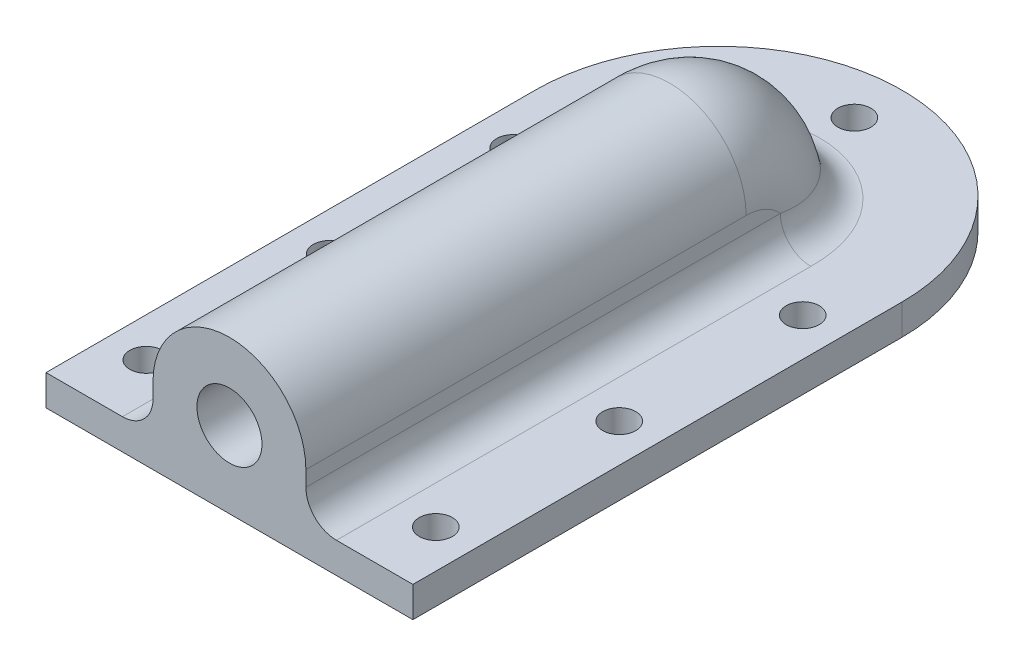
ISO-10303-21;
HEADER;
FILE_DESCRIPTION(('STEP AP214'),'2;1');
FILE_NAME('part.step','',(''),(''),'','','');
FILE_SCHEMA(('AUTOMOTIVE_DESIGN { 1 0 10303 214 1 1 1 1 }'));
ENDSEC;
DATA;
#1=APPLICATION_CONTEXT('core data for automotive mechanical design processes');
#2=APPLICATION_PROTOCOL_DEFINITION('international standard','automotive_design',2000,#1);
#3=PRODUCT_CONTEXT('',#1,'mechanical');
#4=PRODUCT('Part','Part','',(#3));
#5=PRODUCT_RELATED_PRODUCT_CATEGORY('part','',(#4));
#6=PRODUCT_DEFINITION_FORMATION('','',#4);
#7=PRODUCT_DEFINITION_CONTEXT('part definition',#1,'design');
#8=PRODUCT_DEFINITION('design','',#6,#7);
#9=PRODUCT_DEFINITION_SHAPE('','',#8);
#10=(LENGTH_UNIT() NAMED_UNIT(*) SI_UNIT(.MILLI.,.METRE.));
#11=(NAMED_UNIT(*) PLANE_ANGLE_UNIT() SI_UNIT($,.RADIAN.));
#12=(NAMED_UNIT(*) SI_UNIT($,.STERADIAN.) SOLID_ANGLE_UNIT());
#13=UNCERTAINTY_MEASURE_WITH_UNIT(LENGTH_MEASURE(1.E-05),#10,'distance_accuracy_value','');
#14=(GEOMETRIC_REPRESENTATION_CONTEXT(3) GLOBAL_UNCERTAINTY_ASSIGNED_CONTEXT((#13)) GLOBAL_UNIT_ASSIGNED_CONTEXT((#10,
#11,#12)) REPRESENTATION_CONTEXT('',''));
#15=CARTESIAN_POINT('',(0.,0.,0.));
#16=DIRECTION('',(0.,0.,1.));
#17=DIRECTION('',(1.,0.,0.));
#18=AXIS2_PLACEMENT_3D('',#15,#16,#17);
#19=CARTESIAN_POINT('',(0.,3.175,-25.4));
#20=DIRECTION('',(0.,1.,0.));
#21=DIRECTION('',(0.,0.,1.));
#22=AXIS2_PLACEMENT_3D('',#19,#20,#21);
#23=PLANE('',#22);
#24=CARTESIAN_POINT('',(0.,3.175,-39.497));
#25=DIRECTION('',(0.,1.,0.));
#26=DIRECTION('',(0.,0.,1.));
#27=AXIS2_PLACEMENT_3D('',#24,#25,#26);
#28=CIRCLE('',#27,1.7145);
#29=CARTESIAN_POINT('',(0.,3.175,-37.7825));
#30=VERTEX_POINT('',#29);
#31=EDGE_CURVE('E273',#30,#30,#28,.T.);
#32=ORIENTED_EDGE('',*,*,#31,.F.);
#33=EDGE_LOOP('',(#32));
#34=FACE_BOUND('',#33,.T.);
#35=CARTESIAN_POINT('',(-14.986,3.175,0.));
#36=DIRECTION('',(0.,1.,0.));
#37=DIRECTION('',(0.,0.,1.));
#38=AXIS2_PLACEMENT_3D('',#35,#36,#37);
#39=CIRCLE('',#38,1.7145);
#40=CARTESIAN_POINT('',(-14.986,3.175,1.71450000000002));
#41=VERTEX_POINT('',#40);
#42=EDGE_CURVE('E277',#41,#41,#39,.T.);
#43=ORIENTED_EDGE('',*,*,#42,.F.);
#44=EDGE_LOOP('',(#43));
#45=FACE_BOUND('',#44,.T.);
#46=CARTESIAN_POINT('',(-14.986,3.175,-19.05));
#47=DIRECTION('',(0.,1.,0.));
#48=DIRECTION('',(0.,0.,1.));
#49=AXIS2_PLACEMENT_3D('',#46,#47,#48);
#50=CIRCLE('',#49,1.7145);
#51=CARTESIAN_POINT('',(-14.986,3.175,-17.3355));
#52=VERTEX_POINT('',#51);
#53=EDGE_CURVE('E281',#52,#52,#50,.T.);
#54=ORIENTED_EDGE('',*,*,#53,.F.);
#55=EDGE_LOOP('',(#54));
#56=FACE_BOUND('',#55,.T.);
#57=CARTESIAN_POINT('',(15.08125,3.175,19.05));
#58=DIRECTION('',(0.,1.,0.));
#59=DIRECTION('',(0.,0.,1.));
#60=AXIS2_PLACEMENT_3D('',#57,#58,#59);
#61=CIRCLE('',#60,1.7145);
#62=CARTESIAN_POINT('',(15.08125,3.175,20.7645));
#63=VERTEX_POINT('',#62);
#64=EDGE_CURVE('E285',#63,#63,#61,.T.);
#65=ORIENTED_EDGE('',*,*,#64,.F.);
#66=EDGE_LOOP('',(#65));
#67=FACE_BOUND('',#66,.T.);
#68=CARTESIAN_POINT('',(15.08125,3.175,0.));
#69=DIRECTION('',(0.,1.,0.));
#70=DIRECTION('',(0.,0.,1.));
#71=AXIS2_PLACEMENT_3D('',#68,#69,#70);
#72=CIRCLE('',#71,1.7145);
#73=CARTESIAN_POINT('',(15.08125,3.175,1.71450000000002));
#74=VERTEX_POINT('',#73);
#75=EDGE_CURVE('E289',#74,#74,#72,.T.);
#76=ORIENTED_EDGE('',*,*,#75,.F.);
#77=EDGE_LOOP('',(#76));
#78=FACE_BOUND('',#77,.T.);
#79=CARTESIAN_POINT('',(15.08125,3.175,-19.05));
#80=DIRECTION('',(0.,1.,0.));
#81=DIRECTION('',(0.,0.,1.));
#82=AXIS2_PLACEMENT_3D('',#79,#80,#81);
#83=CIRCLE('',#82,1.7145);
#84=CARTESIAN_POINT('',(15.08125,3.175,-17.3355));
#85=VERTEX_POINT('',#84);
#86=EDGE_CURVE('E293',#85,#85,#83,.T.);
#87=ORIENTED_EDGE('',*,*,#86,.F.);
#88=EDGE_LOOP('',(#87));
#89=FACE_BOUND('',#88,.T.);
#90=CARTESIAN_POINT('',(-14.986,3.175,19.05));
#91=DIRECTION('',(0.,1.,0.));
#92=DIRECTION('',(0.,0.,1.));
#93=AXIS2_PLACEMENT_3D('',#90,#91,#92);
#94=CIRCLE('',#93,1.7145);
#95=CARTESIAN_POINT('',(-14.986,3.175,20.7645));
#96=VERTEX_POINT('',#95);
#97=EDGE_CURVE('E297',#96,#96,#94,.T.);
#98=ORIENTED_EDGE('',*,*,#97,.F.);
#99=EDGE_LOOP('',(#98));
#100=FACE_BOUND('',#99,.T.);
#101=CARTESIAN_POINT('',(-11.0284989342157,3.175,-19.1072579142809));
#102=CARTESIAN_POINT('',(-7.46947373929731,3.175,-18.9502189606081));
#103=CARTESIAN_POINT('',(-7.87749923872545,6.71399881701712,-18.9682227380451));
#104=CARTESIAN_POINT('',(-11.0253495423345,3.175,-19.1786091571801));
#105=CARTESIAN_POINT('',(-7.45526203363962,3.175,-19.0262913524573));
#106=CARTESIAN_POINT('',(-7.87524967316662,6.72352057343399,-19.0441069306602));
#107=CARTESIAN_POINT('',(-11.0223552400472,3.175,-19.2499674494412));
#108=CARTESIAN_POINT('',(-7.44172630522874,3.175,-19.1032725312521));
#109=CARTESIAN_POINT('',(-7.87311088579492,6.73252393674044,-19.1208601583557));
#110=CARTESIAN_POINT('',(-11.0167816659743,3.175,-19.3927018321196));
#111=CARTESIAN_POINT('',(-7.41642745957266,3.175,-19.2592166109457));
#112=CARTESIAN_POINT('',(-7.86912976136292,6.74922701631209,-19.2759169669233));
#113=CARTESIAN_POINT('',(-11.0142024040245,3.175,-19.4640779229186));
#114=CARTESIAN_POINT('',(-7.40467549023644,3.175,-19.3381499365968));
#115=CARTESIAN_POINT('',(-7.86728743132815,6.75692670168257,-19.3542205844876));
#116=CARTESIAN_POINT('',(-11.0072444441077,3.175,-19.6782406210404));
#117=CARTESIAN_POINT('',(-7.37278525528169,3.175,-19.5779401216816));
#118=CARTESIAN_POINT('',(-7.86231745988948,6.77766998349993,-19.5911779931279));
#119=CARTESIAN_POINT('',(-11.0036459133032,3.175,-19.8210544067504));
#120=CARTESIAN_POINT('',(-7.3561622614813,3.175,-19.7409349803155));
#121=CARTESIAN_POINT('',(-7.85974708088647,6.78835678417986,-19.7518705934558));
#122=CARTESIAN_POINT('',(-10.9991127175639,3.175,-20.1065298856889));
#123=CARTESIAN_POINT('',(-7.33510978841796,3.175,-20.0709030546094));
#124=CARTESIAN_POINT('',(-7.8565090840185,6.80181888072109,-20.0758436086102));
#125=CARTESIAN_POINT('',(-10.998174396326,3.175,-20.249191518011));
#126=CARTESIAN_POINT('',(-7.33072391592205,3.175,-20.2374054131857));
#127=CARTESIAN_POINT('',(-7.85583885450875,6.80460503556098,-20.2391201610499));
#128=CARTESIAN_POINT('',(-10.9991054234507,3.175,-20.534498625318));
#129=CARTESIAN_POINT('',(-7.33506634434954,3.175,-20.5701271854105));
#130=CARTESIAN_POINT('',(-7.85650387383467,6.80184134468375,-20.5650813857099));
#131=CARTESIAN_POINT('',(-11.0009746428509,3.175,-20.6771441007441));
#132=CARTESIAN_POINT('',(-7.34378074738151,3.175,-20.7358374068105));
#133=CARTESIAN_POINT('',(-7.85783903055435,6.79629188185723,-20.7277660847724));
#134=CARTESIAN_POINT('',(-11.0072028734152,3.175,-20.9618840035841));
#135=CARTESIAN_POINT('',(-7.37258937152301,3.175,-21.062105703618));
#136=CARTESIAN_POINT('',(-7.86228776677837,6.77778336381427,-21.0487778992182));
#137=CARTESIAN_POINT('',(-11.0115532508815,3.175,-21.1039786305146));
#138=CARTESIAN_POINT('',(-7.39256727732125,3.175,-21.222256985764));
#139=CARTESIAN_POINT('',(-7.86539517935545,6.76485000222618,-21.2071181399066));
#140=CARTESIAN_POINT('',(-11.0220596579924,3.175,-21.3881034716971));
#141=CARTESIAN_POINT('',(-7.44038308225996,3.175,-21.5352521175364));
#142=CARTESIAN_POINT('',(-7.87289975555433,6.73343584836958,-21.5177971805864));
#143=CARTESIAN_POINT('',(-11.0282157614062,3.175,-21.53013368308));
#144=CARTESIAN_POINT('',(-7.46813078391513,3.175,-21.6878336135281));
#145=CARTESIAN_POINT('',(-7.87729697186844,6.7149548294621,-21.6701357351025));
#146=CARTESIAN_POINT('',(-11.041442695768,3.175,-21.8141844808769));
#147=CARTESIAN_POINT('',(-7.527570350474,3.175,-21.9848561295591));
#148=CARTESIAN_POINT('',(-7.88674478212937,6.67458327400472,-21.9678407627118));
#149=CARTESIAN_POINT('',(-11.048513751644,3.175,-21.9562050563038));
#150=CARTESIAN_POINT('',(-7.55920216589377,3.175,-22.1291874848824));
#151=CARTESIAN_POINT('',(-7.89179553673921,6.65269189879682,-22.113205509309));
#152=CARTESIAN_POINT('',(-11.0626168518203,3.175,-22.2402455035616));
#153=CARTESIAN_POINT('',(-7.62307115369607,3.175,-22.4102096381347));
#154=CARTESIAN_POINT('',(-7.90186918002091,6.60741336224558,-22.3969437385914));
#155=CARTESIAN_POINT('',(-11.0696488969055,3.175,-22.3822653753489));
#156=CARTESIAN_POINT('',(-7.65529021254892,3.175,-22.546900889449));
#157=CARTESIAN_POINT('',(-7.90689206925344,6.5840262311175,-22.535317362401));
#158=CARTESIAN_POINT('',(-11.0813849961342,3.175,-22.6362708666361));
#159=CARTESIAN_POINT('',(-7.71138521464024,3.175,-22.7857916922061));
#160=CARTESIAN_POINT('',(-7.91527499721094,6.54213143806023,-22.7770914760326));
#161=CARTESIAN_POINT('',(-11.0862666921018,3.175,-22.7482480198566));
#162=CARTESIAN_POINT('',(-7.73555493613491,3.175,-22.8890410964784));
#163=CARTESIAN_POINT('',(-7.91876192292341,6.52363923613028,-22.8816928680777));
#164=CARTESIAN_POINT('',(-11.0950523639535,3.175,-22.9722282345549));
#165=CARTESIAN_POINT('',(-7.78204453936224,3.175,-23.0922056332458));
#166=CARTESIAN_POINT('',(-7.92503740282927,6.48707599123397,-23.0873788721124));
#167=CARTESIAN_POINT('',(-11.098956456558,3.175,-23.0842312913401));
#168=CARTESIAN_POINT('',(-7.80438022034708,3.175,-23.1921606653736));
#169=CARTESIAN_POINT('',(-7.92782604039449,6.46900489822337,-23.1884639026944));
#170=CARTESIAN_POINT('',(-11.1054434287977,3.175,-23.308462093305));
#171=CARTESIAN_POINT('',(-7.84672958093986,3.175,-23.3895288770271));
#172=CARTESIAN_POINT('',(-7.93245959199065,6.43356757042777,-23.3877471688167));
#173=CARTESIAN_POINT('',(-11.1080241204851,3.175,-23.4206899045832));
#174=CARTESIAN_POINT('',(-7.86675922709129,3.175,-23.4869825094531));
#175=CARTESIAN_POINT('',(-7.93430294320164,6.41620254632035,-23.4859403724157));
#176=CARTESIAN_POINT('',(-11.1115532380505,3.175,-23.6451966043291));
#177=CARTESIAN_POINT('',(-7.90414500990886,3.175,-23.6797252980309));
#178=CARTESIAN_POINT('',(-7.93682374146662,6.38238834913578,-23.6797152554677));
#179=CARTESIAN_POINT('',(-11.1125012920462,3.175,-23.7574754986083));
#180=CARTESIAN_POINT('',(-7.92152126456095,3.175,-23.7750582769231));
#181=CARTESIAN_POINT('',(-7.93750092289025,6.36593938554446,-23.7752963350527));
#182=CARTESIAN_POINT('',(-11.1124976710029,3.175,-24.0721542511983));
#183=CARTESIAN_POINT('',(-7.96610099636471,3.175,-24.0392646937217));
#184=CARTESIAN_POINT('',(-7.93749833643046,6.32126822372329,-24.0400310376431));
#185=CARTESIAN_POINT('',(-11.1094106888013,3.175,-24.2745620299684));
#186=CARTESIAN_POINT('',(-7.9902511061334,3.175,-24.2069052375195));
#187=CARTESIAN_POINT('',(-7.93529334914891,6.29419218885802,-24.2066666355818));
#188=CARTESIAN_POINT('',(-11.0958552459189,3.175,-24.6791479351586));
#189=CARTESIAN_POINT('',(-8.02870531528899,3.175,-24.5382036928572));
#190=CARTESIAN_POINT('',(-7.92561088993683,6.24341573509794,-24.5344322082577));
#191=CARTESIAN_POINT('',(-11.0853864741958,3.175,-24.881326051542));
#192=CARTESIAN_POINT('',(-8.04310673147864,3.175,-24.7020777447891));
#193=CARTESIAN_POINT('',(-7.9181331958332,6.21971545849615,-24.6955619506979));
#194=CARTESIAN_POINT('',(-11.0561923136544,3.175,-25.2851192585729));
#195=CARTESIAN_POINT('',(-8.06205272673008,3.175,-25.0268688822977));
#196=CARTESIAN_POINT('',(-7.8972802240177,6.1754172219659,-25.0135129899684));
#197=CARTESIAN_POINT('',(-11.0374661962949,3.175,-25.4867342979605));
#198=CARTESIAN_POINT('',(-8.06667105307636,3.175,-25.1879666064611));
#199=CARTESIAN_POINT('',(-7.88390442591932,6.1548195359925,-25.170333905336));
#200=CARTESIAN_POINT('',(-10.9911413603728,3.175,-25.8889443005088));
#201=CARTESIAN_POINT('',(-8.06618885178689,3.175,-25.5076874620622));
#202=CARTESIAN_POINT('',(-7.85081525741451,6.11636612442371,-25.4803662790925));
#203=CARTESIAN_POINT('',(-10.9635420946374,3.175,-26.0895391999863));
#204=CARTESIAN_POINT('',(-8.06114235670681,3.175,-25.6664608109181));
#205=CARTESIAN_POINT('',(-7.83110149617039,6.09851056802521,-25.6335775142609));
#206=CARTESIAN_POINT('',(-10.8668084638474,3.175,-26.6886371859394));
#207=CARTESIAN_POINT('',(-8.03177976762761,3.175,-26.1378549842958));
#208=CARTESIAN_POINT('',(-7.76200604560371,6.04851782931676,-26.0881133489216));
#209=CARTESIAN_POINT('',(-10.7837014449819,3.175,-27.085002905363));
#210=CARTESIAN_POINT('',(-7.99334605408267,3.175,-26.448997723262));
#211=CARTESIAN_POINT('',(-7.70264388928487,6.01989664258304,-26.3847679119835));
#212=CARTESIAN_POINT('',(-10.5783776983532,3.175,-27.8674623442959));
#213=CARTESIAN_POINT('',(-7.8799714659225,3.175,-27.0607984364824));
#214=CARTESIAN_POINT('',(-7.55598407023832,5.96948384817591,-26.9660096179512));
#215=CARTESIAN_POINT('',(-10.4561663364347,3.175,-28.2535574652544));
#216=CARTESIAN_POINT('',(-7.80518167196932,3.175,-27.3621408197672));
#217=CARTESIAN_POINT('',(-7.46869024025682,5.947691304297,-27.2505984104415));
#218=CARTESIAN_POINT('',(-10.2029878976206,3.175,-28.9295303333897));
#219=CARTESIAN_POINT('',(-7.6406846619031,3.175,-27.8888836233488));
#220=CARTESIAN_POINT('',(-7.28784849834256,5.9132389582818,-27.7465915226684));
#221=CARTESIAN_POINT('',(-10.0795537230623,3.175,-29.2222461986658));
#222=CARTESIAN_POINT('',(-7.55774849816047,3.175,-28.1167112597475));
#223=CARTESIAN_POINT('',(-7.19968123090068,5.89962298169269,-27.9605744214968));
#224=CARTESIAN_POINT('',(-9.80886918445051,3.175,-29.7964220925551));
#225=CARTESIAN_POINT('',(-7.37147140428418,3.175,-28.5631580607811));
#226=CARTESIAN_POINT('',(-7.00633513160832,5.87481857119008,-28.379269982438));
#227=CARTESIAN_POINT('',(-9.66162293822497,3.175,-30.0778840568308));
#228=CARTESIAN_POINT('',(-7.26813997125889,3.175,-28.7819619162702));
#229=CARTESIAN_POINT('',(-6.90115924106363,5.86362971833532,-28.5839842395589));
#230=CARTESIAN_POINT('',(-9.3439145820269,3.175,-30.6276063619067));
#231=CARTESIAN_POINT('',(-7.04200293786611,3.175,-29.209017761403));
#232=CARTESIAN_POINT('',(-6.6742247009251,5.84318271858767,-28.9831131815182));
#233=CARTESIAN_POINT('',(-9.17343916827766,3.175,-30.8958590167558));
#234=CARTESIAN_POINT('',(-6.91917912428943,3.175,-29.4174085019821));
#235=CARTESIAN_POINT('',(-6.55245654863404,5.83392568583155,-29.1775218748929));
#236=CARTESIAN_POINT('',(-8.81026393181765,3.175,-31.4170228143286));
#237=CARTESIAN_POINT('',(-6.65515473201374,3.175,-29.8220803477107));
#238=CARTESIAN_POINT('',(-6.29304566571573,5.81698006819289,-29.5547464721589));
#239=CARTESIAN_POINT('',(-8.61755631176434,3.175,-31.6699285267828));
#240=CARTESIAN_POINT('',(-6.51393250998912,3.175,-30.0184725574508));
#241=CARTESIAN_POINT('',(-6.15539736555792,5.80929203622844,-29.7375582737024));
#242=CARTESIAN_POINT('',(-8.21104611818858,3.175,-32.1585240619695));
#243=CARTESIAN_POINT('',(-6.2142383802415,3.175,-30.3977562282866));
#244=CARTESIAN_POINT('',(-5.86503294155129,5.79520337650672,-30.0904130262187));
#245=CARTESIAN_POINT('',(-7.99722688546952,3.175,-32.3942000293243));
#246=CARTESIAN_POINT('',(-6.05573219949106,3.175,-30.5807297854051));
#247=CARTESIAN_POINT('',(-5.71230491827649,5.78880377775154,-30.2604457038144));
#248=CARTESIAN_POINT('',(-7.55000269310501,3.175,-32.8463551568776));
#249=CARTESIAN_POINT('',(-5.72282555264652,3.175,-30.9316795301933));
#250=CARTESIAN_POINT('',(-5.39285906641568,5.77708327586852,-30.5864389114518));
#251=CARTESIAN_POINT('',(-7.31659034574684,3.175,-33.0628270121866));
#252=CARTESIAN_POINT('',(-5.54839511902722,3.175,-31.0997249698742));
#253=CARTESIAN_POINT('',(-5.22613596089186,5.77176278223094,-30.7423940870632));
#254=CARTESIAN_POINT('',(-6.8320814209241,3.175,-33.4746269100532));
#255=CARTESIAN_POINT('',(-5.18525515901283,3.175,-31.4193341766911));
#256=CARTESIAN_POINT('',(-4.88005815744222,5.76204203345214,-31.0389202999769));
#257=CARTESIAN_POINT('',(-6.58099721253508,3.175,-33.6699695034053));
#258=CARTESIAN_POINT('',(-4.99652972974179,3.175,-31.5709695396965));
#259=CARTESIAN_POINT('',(-4.70071229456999,5.75764114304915,-31.1795019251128));
#260=CARTESIAN_POINT('',(-6.0627340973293,3.175,-34.0382117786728));
#261=CARTESIAN_POINT('',(-4.60615814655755,3.175,-31.8567680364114));
#262=CARTESIAN_POINT('',(-4.33052435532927,5.74962648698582,-31.444412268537));
#263=CARTESIAN_POINT('',(-5.79554934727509,3.175,-34.2111032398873));
#264=CARTESIAN_POINT('',(-4.40447974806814,3.175,-31.990973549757));
#265=CARTESIAN_POINT('',(-4.13967810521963,5.74601300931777,-31.5687350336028));
#266=CARTESIAN_POINT('',(-5.25398975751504,3.175,-34.528979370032));
#267=CARTESIAN_POINT('',(-3.99506405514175,3.175,-32.2376867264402));
#268=CARTESIAN_POINT('',(-3.75284982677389,5.73955872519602,-31.7972476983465));
#269=CARTESIAN_POINT('',(-4.97995973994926,3.175,-34.6745518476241));
#270=CARTESIAN_POINT('',(-3.78758041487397,3.175,-32.350685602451));
#271=CARTESIAN_POINT('',(-3.55711409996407,5.73670091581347,-31.9018619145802));
#272=CARTESIAN_POINT('',(-4.42041488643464,3.175,-34.9419329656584));
#273=CARTESIAN_POINT('',(-3.36345487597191,3.175,-32.5582094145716));
#274=CARTESIAN_POINT('',(-3.15743920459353,5.73157168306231,-32.0939724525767));
#275=CARTESIAN_POINT('',(-4.1348959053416,3.175,-35.0637329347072));
#276=CARTESIAN_POINT('',(-3.14678276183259,3.175,-32.6527563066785));
#277=CARTESIAN_POINT('',(-2.9534970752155,5.72930047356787,-32.1814625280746));
#278=CARTESIAN_POINT('',(-3.55462415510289,3.175,-35.282544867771));
#279=CARTESIAN_POINT('',(-2.70608721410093,3.175,-32.8225874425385));
#280=CARTESIAN_POINT('',(-2.53901725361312,5.7252933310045,-32.3386133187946));
#281=CARTESIAN_POINT('',(-3.25987457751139,3.175,-35.3795652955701));
#282=CARTESIAN_POINT('',(-2.48203920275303,3.175,-32.8979003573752));
#283=CARTESIAN_POINT('',(-2.32848184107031,5.72355721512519,-32.4082801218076));
#284=CARTESIAN_POINT('',(-2.66306983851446,3.175,-35.5481719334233));
#285=CARTESIAN_POINT('',(-2.02814807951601,3.175,-33.0287671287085));
#286=CARTESIAN_POINT('',(-1.90219274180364,5.72057947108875,-32.5293377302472));
#287=CARTESIAN_POINT('',(-2.36101203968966,3.175,-35.6197488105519));
#288=CARTESIAN_POINT('',(-1.79827547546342,3.175,-33.0843300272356));
#289=CARTESIAN_POINT('',(-1.68643717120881,5.71933802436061,-32.5807218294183));
#290=CARTESIAN_POINT('',(-1.75502846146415,3.175,-35.7362748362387));
#291=CARTESIAN_POINT('',(-1.33695731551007,3.175,-33.1747751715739));
#292=CARTESIAN_POINT('',(-1.25359175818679,5.71733364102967,-32.6643690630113));
#293=CARTESIAN_POINT('',(-1.45115387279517,3.175,-35.7814903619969));
#294=CARTESIAN_POINT('',(-1.10552611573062,3.175,-33.2098748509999));
#295=CARTESIAN_POINT('',(-1.03653848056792,5.71656591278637,-32.6968234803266));
#296=CARTESIAN_POINT('',(-0.840564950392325,3.175,-35.8461065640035));
#297=CARTESIAN_POINT('',(-0.640432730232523,3.175,-33.2600290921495));
#298=CARTESIAN_POINT('',(-0.600403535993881,5.71547261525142,-32.743201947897));
#299=CARTESIAN_POINT('',(-0.533849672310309,3.175,-35.8654983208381));
#300=CARTESIAN_POINT('',(-0.40674307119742,3.175,-33.2750825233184));
#301=CARTESIAN_POINT('',(-0.381321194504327,5.71514719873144,-32.7571195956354));
#302=CARTESIAN_POINT('',(0.0800523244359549,3.175,-35.878292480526));
#303=CARTESIAN_POINT('',(0.0609872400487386,3.175,-33.285013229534));
#304=CARTESIAN_POINT('',(0.0571802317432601,5.71493224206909,-32.7663021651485));
#305=CARTESIAN_POINT('',(0.387238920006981,3.175,-35.8717007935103));
#306=CARTESIAN_POINT('',(0.295054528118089,3.175,-33.2798962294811));
#307=CARTESIAN_POINT('',(0.276599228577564,5.71504260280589,-32.7615713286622));
#308=CARTESIAN_POINT('',(0.999957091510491,3.175,-35.8325902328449));
#309=CARTESIAN_POINT('',(0.761844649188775,3.175,-33.249539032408));
#310=CARTESIAN_POINT('',(0.714255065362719,5.7157012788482,-32.7335005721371));
#311=CARTESIAN_POINT('',(1.30548866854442,3.175,-35.8000713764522));
#312=CARTESIAN_POINT('',(0.994594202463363,3.175,-33.2242953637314));
#313=CARTESIAN_POINT('',(0.932491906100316,5.7162495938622,-32.7101606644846));
#314=CARTESIAN_POINT('',(1.91193641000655,3.175,-35.7094636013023));
#315=CARTESIAN_POINT('',(1.45641740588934,3.175,-33.1539671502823));
#316=CARTESIAN_POINT('',(1.36566886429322,5.71779370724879,-32.6451231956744));
#317=CARTESIAN_POINT('',(2.21286238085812,3.175,-35.6514402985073));
#318=CARTESIAN_POINT('',(1.68552556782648,3.175,-33.1089253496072));
#319=CARTESIAN_POINT('',(1.58061598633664,5.7187883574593,-32.6034727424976));
#320=CARTESIAN_POINT('',(2.80865746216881,3.175,-35.5102908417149));
#321=CARTESIAN_POINT('',(2.13889109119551,3.175,-32.999368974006));
#322=CARTESIAN_POINT('',(2.00618390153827,5.72124547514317,-32.5021405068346));
#323=CARTESIAN_POINT('',(3.10352863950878,3.175,-35.4271734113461));
#324=CARTESIAN_POINT('',(2.36317651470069,3.175,-32.9348481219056));
#325=CARTESIAN_POINT('',(2.21680617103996,5.72270778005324,-32.4424649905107));
#326=CARTESIAN_POINT('',(3.68534308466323,3.175,-35.2364055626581));
#327=CARTESIAN_POINT('',(2.80539036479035,3.175,-32.786781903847));
#328=CARTESIAN_POINT('',(2.63238791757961,5.72613261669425,-32.3054778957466));
#329=CARTESIAN_POINT('',(3.97228344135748,3.175,-35.1287462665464));
#330=CARTESIAN_POINT('',(3.02334268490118,3.175,-32.703211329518));
#331=CARTESIAN_POINT('',(2.837345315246,5.72809532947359,-32.228159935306));
#332=CARTESIAN_POINT('',(4.53600268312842,3.175,-34.8897470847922));
#333=CARTESIAN_POINT('',(3.45110327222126,3.175,-32.5177137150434));
#334=CARTESIAN_POINT('',(3.2400019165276,5.73256383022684,-32.0564804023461));
#335=CARTESIAN_POINT('',(4.81278520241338,3.175,-34.7584157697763));
#336=CARTESIAN_POINT('',(3.66094051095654,3.175,-32.4157691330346));
#337=CARTESIAN_POINT('',(3.43770371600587,5.73506942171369,-31.9621249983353));
#338=CARTESIAN_POINT('',(5.35493840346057,3.175,-34.4727082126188));
#339=CARTESIAN_POINT('',(4.07142364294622,3.175,-32.1940232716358));
#340=CARTESIAN_POINT('',(3.82495600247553,5.74068833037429,-31.7568002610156));
#341=CARTESIAN_POINT('',(5.62028365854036,3.175,-34.3182837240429));
#342=CARTESIAN_POINT('',(4.27207455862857,3.175,-32.0741538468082));
#343=CARTESIAN_POINT('',(4.01448832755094,5.74380292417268,-31.6457961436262));
#344=CARTESIAN_POINT('',(6.13699897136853,3.175,-33.9877931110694));
#345=CARTESIAN_POINT('',(4.66213041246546,3.175,-31.8176543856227));
#346=CARTESIAN_POINT('',(4.38357069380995,5.75071149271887,-31.408145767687));
#347=CARTESIAN_POINT('',(6.38837401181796,3.175,-33.8117347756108));
#348=CARTESIAN_POINT('',(4.85156459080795,3.175,-31.6809916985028));
#349=CARTESIAN_POINT('',(4.56312429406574,5.75450522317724,-31.2815051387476));
#350=CARTESIAN_POINT('',(6.87560189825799,3.175,-33.4391697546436));
#351=CARTESIAN_POINT('',(5.21789182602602,3.175,-31.3918374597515));
#352=CARTESIAN_POINT('',(4.91114421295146,5.76287225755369,-31.0133907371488));
#353=CARTESIAN_POINT('',(7.11145004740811,3.175,-33.242656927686));
#354=CARTESIAN_POINT('',(5.39480526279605,3.175,-31.2392934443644));
#355=CARTESIAN_POINT('',(5.07960717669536,5.76744579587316,-30.871912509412));
#356=CARTESIAN_POINT('',(7.56587306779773,3.175,-32.8307408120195));
#357=CARTESIAN_POINT('',(5.73462396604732,3.175,-30.9195895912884));
#358=CARTESIAN_POINT('',(5.40419504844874,5.77749602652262,-30.5751775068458));
#359=CARTESIAN_POINT('',(7.78445395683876,3.175,-32.615344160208));
#360=CARTESIAN_POINT('',(5.8975569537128,3.175,-30.7523761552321));
#361=CARTESIAN_POINT('',(5.56032425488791,5.78297240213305,-30.4199255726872));
#362=CARTESIAN_POINT('',(8.20465920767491,3.175,-32.1654011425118));
#363=CARTESIAN_POINT('',(6.20946552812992,3.175,-30.4031293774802));
#364=CARTESIAN_POINT('',(5.86047086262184,5.79503889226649,-30.0953640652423));
#365=CARTESIAN_POINT('',(8.4061359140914,3.175,-31.9307168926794));
#366=CARTESIAN_POINT('',(6.35833956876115,3.175,-30.2209181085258));
#367=CARTESIAN_POINT('',(6.00438279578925,5.80163746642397,-29.9259530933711));
#368=CARTESIAN_POINT('',(8.7888318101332,3.175,-31.4455113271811));
#369=CARTESIAN_POINT('',(6.63943102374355,3.175,-29.8442422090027));
#370=CARTESIAN_POINT('',(6.27773700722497,5.81612941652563,-29.575330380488));
#371=CARTESIAN_POINT('',(8.97005783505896,3.175,-31.1949954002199));
#372=CARTESIAN_POINT('',(6.77167164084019,3.175,-29.649690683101));
#373=CARTESIAN_POINT('',(6.40718416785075,5.82402235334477,-29.3941226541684));
#374=CARTESIAN_POINT('',(9.31134183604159,3.175,-30.6797558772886));
#375=CARTESIAN_POINT('',(7.01854598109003,3.175,-29.2495753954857));
#376=CARTESIAN_POINT('',(6.65095845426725,5.84138748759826,-29.0209018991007));
#377=CARTESIAN_POINT('',(9.47138873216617,3.175,-30.4150249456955));
#378=CARTESIAN_POINT('',(7.13318247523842,3.175,-29.0438932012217));
#379=CARTESIAN_POINT('',(6.76527766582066,5.85086050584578,-28.8288832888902));
#380=CARTESIAN_POINT('',(9.76930757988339,3.175,-29.8734864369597));
#381=CARTESIAN_POINT('',(7.34375763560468,3.175,-28.6231211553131));
#382=CARTESIAN_POINT('',(6.97807684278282,5.87174486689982,-28.4353210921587));
#383=CARTESIAN_POINT('',(9.90718648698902,3.175,-29.5966826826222));
#384=CARTESIAN_POINT('',(7.43970612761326,3.175,-28.4078927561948));
#385=CARTESIAN_POINT('',(7.07656177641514,5.88315559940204,-28.2337805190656));
#386=CARTESIAN_POINT('',(10.1630998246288,3.175,-29.0265552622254));
#387=CARTESIAN_POINT('',(7.6140198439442,3.175,-27.9644509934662));
#388=CARTESIAN_POINT('',(7.25935701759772,5.90868224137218,-27.8175370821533));
#389=CARTESIAN_POINT('',(10.2806181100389,3.175,-28.7330000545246));
#390=CARTESIAN_POINT('',(7.69192451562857,3.175,-27.7358831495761));
#391=CARTESIAN_POINT('',(7.34329865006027,5.92285322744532,-27.6026401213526));
#392=CARTESIAN_POINT('',(10.4916567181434,3.175,-28.1373882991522));
#393=CARTESIAN_POINT('',(7.82646782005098,3.175,-27.271803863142));
#394=CARTESIAN_POINT('',(7.49404051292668,5.95440952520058,-27.1648592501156));
#395=CARTESIAN_POINT('',(10.585175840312,3.175,-27.8353313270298));
#396=CARTESIAN_POINT('',(7.88307382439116,3.175,-27.0360460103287));
#397=CARTESIAN_POINT('',(7.56083988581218,5.97179499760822,-26.9419749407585));
#398=CARTESIAN_POINT('',(10.7482693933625,3.175,-27.225235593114));
#399=CARTESIAN_POINT('',(7.97418495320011,3.175,-26.5591360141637));
#400=CARTESIAN_POINT('',(7.67733528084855,6.01065996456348,-26.4890791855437));
#401=CARTESIAN_POINT('',(10.8178720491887,3.175,-26.9172043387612));
#402=CARTESIAN_POINT('',(8.00865009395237,3.175,-26.3176683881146));
#403=CARTESIAN_POINT('',(7.72705146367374,6.03213458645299,-26.2590764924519));
#404=CARTESIAN_POINT('',(10.933978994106,3.175,-26.2968947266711));
#405=CARTESIAN_POINT('',(8.05485170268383,3.175,-25.829891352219));
#406=CARTESIAN_POINT('',(7.80998499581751,6.08035913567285,-25.7916584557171));
#407=CARTESIAN_POINT('',(10.9804881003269,3.175,-25.984617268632));
#408=CARTESIAN_POINT('',(8.06647092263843,3.175,-25.5831573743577));
#409=CARTESIAN_POINT('',(7.84320578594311,6.10710796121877,-25.55424466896));
#410=CARTESIAN_POINT('',(11.0332445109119,3.175,-25.5217447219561));
#411=CARTESIAN_POINT('',(8.06642271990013,3.175,-25.2159637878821));
#412=CARTESIAN_POINT('',(7.88088893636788,6.151529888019,-25.197252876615));
#413=CARTESIAN_POINT('',(11.0478253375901,3.175,-25.3720422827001));
#414=CARTESIAN_POINT('',(8.06372453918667,3.175,-25.0964787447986));
#415=CARTESIAN_POINT('',(7.89130381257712,6.16662893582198,-25.0810144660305));
#416=CARTESIAN_POINT('',(11.0723474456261,3.175,-25.0722725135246));
#417=CARTESIAN_POINT('',(8.05297322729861,3.175,-24.8561205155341));
#418=CARTESIAN_POINT('',(7.90881960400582,6.19849527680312,-24.846256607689));
#419=CARTESIAN_POINT('',(11.082289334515,3.175,-24.9222052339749));
#420=CARTESIAN_POINT('',(8.04489226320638,3.175,-24.735176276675));
#421=CARTESIAN_POINT('',(7.91592095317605,6.21526235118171,-24.727737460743));
#422=CARTESIAN_POINT('',(11.0978537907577,3.175,-24.6217824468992));
#423=CARTESIAN_POINT('',(8.02336189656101,3.175,-24.4915284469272));
#424=CARTESIAN_POINT('',(7.92703842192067,6.25060343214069,-24.4879465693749));
#425=CARTESIAN_POINT('',(11.1034743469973,3.175,-24.4714268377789));
#426=CARTESIAN_POINT('',(8.00987466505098,3.175,-24.3687429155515));
#427=CARTESIAN_POINT('',(7.93105310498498,6.26917827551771,-24.3666735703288));
#428=CARTESIAN_POINT('',(11.1107981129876,3.175,-24.1706329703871));
#429=CARTESIAN_POINT('',(7.97761004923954,3.175,-24.1209687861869));
#430=CARTESIAN_POINT('',(7.93628436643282,6.30819598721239,-24.1208573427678));
#431=CARTESIAN_POINT('',(11.1125015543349,3.175,-24.0201947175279));
#432=CARTESIAN_POINT('',(7.95879062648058,3.175,-23.9958881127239));
#433=CARTESIAN_POINT('',(7.93750111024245,6.32863874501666,-23.9963143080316));
#434=CARTESIAN_POINT('',(11.1124979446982,3.175,-23.6708348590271));
#435=CARTESIAN_POINT('',(7.90912642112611,3.175,-23.701666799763));
#436=CARTESIAN_POINT('',(7.93749853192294,6.37824605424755,-23.7024119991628));
#437=CARTESIAN_POINT('',(11.1095147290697,3.175,-23.4719143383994));
#438=CARTESIAN_POINT('',(7.87633300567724,3.175,-23.5315318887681));
#439=CARTESIAN_POINT('',(7.93536766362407,6.40809808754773,-23.5315457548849));
#440=CARTESIAN_POINT('',(11.0991121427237,3.175,-23.074185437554));
#441=CARTESIAN_POINT('',(7.80313295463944,3.175,-23.183583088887));
#442=CARTESIAN_POINT('',(7.9279372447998,6.47034734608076,-23.1805251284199));
#443=CARTESIAN_POINT('',(11.0916923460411,3.175,-22.8753770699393));
#444=CARTESIAN_POINT('',(7.76261188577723,3.175,-23.0055186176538));
#445=CARTESIAN_POINT('',(7.92263739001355,6.50274481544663,-23.0003698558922));
#446=CARTESIAN_POINT('',(11.0744072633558,3.175,-22.4778107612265));
#447=CARTESIAN_POINT('',(7.67689783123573,3.175,-22.6380923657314));
#448=CARTESIAN_POINT('',(7.9102909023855,6.56823087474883,-22.6281688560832));
#449=CARTESIAN_POINT('',(11.0645411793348,3.175,-22.2790528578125));
#450=CARTESIAN_POINT('',(7.6316339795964,3.175,-22.4485264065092));
#451=CARTESIAN_POINT('',(7.9032436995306,6.60131968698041,-22.436119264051));
#452=CARTESIAN_POINT('',(11.0448088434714,3.175,-21.8815414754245));
#453=CARTESIAN_POINT('',(7.54234231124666,3.175,-22.0543019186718));
#454=CARTESIAN_POINT('',(7.88914917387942,6.66449333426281,-22.0381755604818));
#455=CARTESIAN_POINT('',(11.0349425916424,3.175,-21.6827879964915));
#456=CARTESIAN_POINT('',(7.49836644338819,3.175,-21.8496464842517));
#457=CARTESIAN_POINT('',(7.88210185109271,6.69457825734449,-21.8322818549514));
#458=CARTESIAN_POINT('',(11.0221069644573,3.175,-21.3850515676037));
#459=CARTESIAN_POINT('',(7.44059829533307,3.175,-21.5315292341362));
#460=CARTESIAN_POINT('',(7.87293354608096,6.73328479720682,-21.5140378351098));
#461=CARTESIAN_POINT('',(11.0181629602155,3.175,-21.2861125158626));
#462=CARTESIAN_POINT('',(7.42271501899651,3.175,-21.4236288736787));
#463=CARTESIAN_POINT('',(7.87011640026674,6.74509578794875,-21.4066624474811));
#464=CARTESIAN_POINT('',(11.0111989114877,3.175,-21.088202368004));
#465=CARTESIAN_POINT('',(7.39094009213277,3.175,-21.2042017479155));
#466=CARTESIAN_POINT('',(7.86514207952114,6.76589212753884,-21.1891498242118));
#467=CARTESIAN_POINT('',(11.0081788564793,3.175,-20.9892312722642));
#468=CARTESIAN_POINT('',(7.37707936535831,3.175,-21.0927713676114));
#469=CARTESIAN_POINT('',(7.86298489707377,6.77487750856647,-21.0790126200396));
#470=CARTESIAN_POINT('',(11.0032926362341,3.175,-20.7912625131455));
#471=CARTESIAN_POINT('',(7.35453021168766,3.175,-20.8671101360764));
#472=CARTESIAN_POINT('',(7.85949473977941,6.78940551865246,-20.8567109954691));
#473=CARTESIAN_POINT('',(11.0014264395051,3.175,-20.6922648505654));
#474=CARTESIAN_POINT('',(7.34586943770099,3.175,-20.753012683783));
#475=CARTESIAN_POINT('',(7.85816174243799,6.79494824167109,-20.7445466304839));
#476=CARTESIAN_POINT('',(10.9989943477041,3.175,-20.4942539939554));
#477=CARTESIAN_POINT('',(7.33455084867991,3.175,-20.5232684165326));
#478=CARTESIAN_POINT('',(7.85642453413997,6.80217098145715,-20.5191836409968));
#479=CARTESIAN_POINT('',(10.9984284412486,3.175,-20.3952408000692));
#480=CARTESIAN_POINT('',(7.33190895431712,3.175,-20.4077822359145));
#481=CARTESIAN_POINT('',(7.85602031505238,6.8038510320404,-20.405985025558));
#482=CARTESIAN_POINT('',(10.9986426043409,3.175,-20.1971223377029));
#483=CARTESIAN_POINT('',(7.33290817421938,3.175,-20.1766557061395));
#484=CARTESIAN_POINT('',(7.85617328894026,6.80321525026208,-20.1795734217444));
#485=CARTESIAN_POINT('',(10.999423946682,3.175,-20.0980170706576));
#486=CARTESIAN_POINT('',(7.33655375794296,3.175,-20.0611853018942));
#487=CARTESIAN_POINT('',(7.85673139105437,6.80089563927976,-20.0663605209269));
#488=CARTESIAN_POINT('',(11.002271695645,3.175,-19.8998232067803));
#489=CARTESIAN_POINT('',(7.3497939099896,3.175,-19.8317022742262));
#490=CARTESIAN_POINT('',(7.85876549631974,6.79243733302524,-19.8411392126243));
#491=CARTESIAN_POINT('',(11.0043381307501,3.175,-19.8007346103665));
#492=CARTESIAN_POINT('',(7.35937017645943,3.175,-19.7178473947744));
#493=CARTESIAN_POINT('',(7.86024151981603,6.78629855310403,-19.7291308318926));
#494=CARTESIAN_POINT('',(11.0095976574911,3.175,-19.6025600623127));
#495=CARTESIAN_POINT('',(7.38359811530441,3.175,-19.4928328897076));
#496=CARTESIAN_POINT('',(7.86399832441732,6.77065547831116,-19.50726626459));
#497=CARTESIAN_POINT('',(11.0127910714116,3.175,-19.5034741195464));
#498=CARTESIAN_POINT('',(7.39822219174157,3.175,-19.3818022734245));
#499=CARTESIAN_POINT('',(7.86627933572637,6.76115022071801,-19.3974107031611));
#500=CARTESIAN_POINT('',(11.0200522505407,3.175,-19.3053393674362));
#501=CARTESIAN_POINT('',(7.43129529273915,3.175,-19.1632624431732));
#502=CARTESIAN_POINT('',(7.87146589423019,6.73943651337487,-19.1805329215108));
#503=CARTESIAN_POINT('',(11.024119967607,3.175,-19.2062905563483));
#504=CARTESIAN_POINT('',(7.44971352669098,3.175,-19.0558429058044));
#505=CARTESIAN_POINT('',(7.87437140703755,6.72722821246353,-19.0735105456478));
#506=CARTESIAN_POINT('',(11.0284989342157,3.175,-19.1072579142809));
#507=CARTESIAN_POINT('',(7.46947373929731,3.175,-18.9502189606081));
#508=CARTESIAN_POINT('',(7.87749923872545,6.71399881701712,-18.9682227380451));
#509=(BOUNDED_SURFACE() B_SPLINE_SURFACE(3,2,((#101,#102,#103),(#104,#105,#106),(#107,#108,
#109),(#110,#111,#112),(#113,#114,#115),(#116,#117,#118),(#119,#120,#121),(#122,#123,#124),
(#125,#126,#127),(#128,#129,#130),(#131,#132,#133),(#134,#135,#136),(#137,#138,#139),(#140,#141,
#142),(#143,#144,#145),(#146,#147,#148),(#149,#150,#151),(#152,#153,#154),(#155,#156,#157),
(#158,#159,#160),(#161,#162,#163),(#164,#165,#166),(#167,#168,#169),(#170,#171,#172),(#173,#174,
#175),(#176,#177,#178),(#179,#180,#181),(#182,#183,#184),(#185,#186,#187),(#188,#189,#190),
(#191,#192,#193),(#194,#195,#196),(#197,#198,#199),(#200,#201,#202),(#203,#204,#205),(#206,#207,
#208),(#209,#210,#211),(#212,#213,#214),(#215,#216,#217),(#218,#219,#220),(#221,#222,#223),
(#224,#225,#226),(#227,#228,#229),(#230,#231,#232),(#233,#234,#235),(#236,#237,#238),(#239,#240,
#241),(#242,#243,#244),(#245,#246,#247),(#248,#249,#250),(#251,#252,#253),(#254,#255,#256),
(#257,#258,#259),(#260,#261,#262),(#263,#264,#265),(#266,#267,#268),(#269,#270,#271),(#272,#273,
#274),(#275,#276,#277),(#278,#279,#280),(#281,#282,#283),(#284,#285,#286),(#287,#288,#289),
(#290,#291,#292),(#293,#294,#295),(#296,#297,#298),(#299,#300,#301),(#302,#303,#304),(#305,#306,
#307),(#308,#309,#310),(#311,#312,#313),(#314,#315,#316),(#317,#318,#319),(#320,#321,#322),
(#323,#324,#325),(#326,#327,#328),(#329,#330,#331),(#332,#333,#334),(#335,#336,#337),(#338,#339,
#340),(#341,#342,#343),(#344,#345,#346),(#347,#348,#349),(#350,#351,#352),(#353,#354,#355),
(#356,#357,#358),(#359,#360,#361),(#362,#363,#364),(#365,#366,#367),(#368,#369,#370),(#371,#372,
#373),(#374,#375,#376),(#377,#378,#379),(#380,#381,#382),(#383,#384,#385),(#386,#387,#388),
(#389,#390,#391),(#392,#393,#394),(#395,#396,#397),(#398,#399,#400),(#401,#402,#403),(#404,#405,
#406),(#407,#408,#409),(#410,#411,#412),(#413,#414,#415),(#416,#417,#418),(#419,#420,#421),
(#422,#423,#424),(#425,#426,#427),(#428,#429,#430),(#431,#432,#433),(#434,#435,#436),(#437,#438,
#439),(#440,#441,#442),(#443,#444,#445),(#446,#447,#448),(#449,#450,#451),(#452,#453,#454),
(#455,#456,#457),(#458,#459,#460),(#461,#462,#463),(#464,#465,#466),(#467,#468,#469),(#470,#471,
#472),(#473,#474,#475),(#476,#477,#478),(#479,#480,#481),(#482,#483,#484),(#485,#486,#487),
(#488,#489,#490),(#491,#492,#493),(#494,#495,#496),(#497,#498,#499),(#500,#501,#502),(#503,#504,
#505),(#506,#507,#508)),.UNSPECIFIED.,.F.,.F.,.F.) B_SPLINE_SURFACE_WITH_KNOTS((4,2,2,2,2,2,2,2,
2,2,2,2,2,2,2,2,2,2,2,2,2,2,2,2,2,2,2,2,2,2,2,2,2,2,2,2,2,2,2,2,2,2,2,2,2,2,2,2,2,2,2,2,2,2,2,2,
2,2,2,2,2,2,2,2,2,2,2,4),(3,3),(0.,0.214262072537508,0.428529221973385,0.85708528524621,
1.28505203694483,1.71299913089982,2.13946610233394,2.56595049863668,2.99253993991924,
3.41912076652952,3.75536852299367,4.09157611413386,4.42833777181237,4.76517612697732,
5.37234910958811,5.97954767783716,6.58679982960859,7.1940894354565,8.40702311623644,
9.61979043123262,10.5717889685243,11.5236230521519,12.4760045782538,13.428721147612,
14.3821956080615,15.3360312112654,16.2892057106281,17.2427282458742,18.1725019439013,
19.1026141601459,20.0324082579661,20.962543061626,21.8831083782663,22.8039915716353,
23.7246653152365,24.6453384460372,25.5636566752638,26.4816560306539,27.3999879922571,
28.3179881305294,29.2379336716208,30.1575489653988,31.0774411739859,31.997011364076,
32.9238487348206,33.8503723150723,34.7773787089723,35.7040936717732,36.6516541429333,
37.5992620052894,38.5457476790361,39.4920358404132,39.94321122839,40.3943275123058,
40.8456536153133,41.2969530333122,41.893707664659,42.4905196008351,43.0875264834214,
43.6845158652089,43.9815653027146,44.2786113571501,44.5756493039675,44.8726846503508,
45.1700007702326,45.4673234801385,45.7647312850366,46.0621227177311),(0.,1.),
.UNSPECIFIED.) GEOMETRIC_REPRESENTATION_ITEM() RATIONAL_B_SPLINE_SURFACE(((1.,0.665340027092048,
1.),(1.,0.664213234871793,1.),(1.,0.663144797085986,1.),(1.,0.661158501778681,1.),(1.,
0.660240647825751,1.),(1.,0.65776376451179,1.),(1.,0.656481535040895,1.),(1.,0.654864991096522,
1.),(1.,0.654529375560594,1.),(1.,0.654861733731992,1.),(1.,0.655529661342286,1.),(1.,
0.657748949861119,1.),(1.,0.659297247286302,1.),(1.,0.66303833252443,1.),(1.,0.665231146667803,
1.),(1.,0.669992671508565,1.),(1.,0.672561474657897,1.),(1.,0.677841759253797,1.),(1.,
0.680553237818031,1.),(1.,0.685381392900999,1.),(1.,0.68750243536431,1.),(1.,0.69167737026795,
1.),(1.,0.693731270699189,1.),(1.,0.697741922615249,1.),(1.,0.699698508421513,1.),(1.,
0.703493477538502,1.),(1.,0.705331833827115,1.),(1.,0.710306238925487,1.),(1.,0.713299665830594,
1.),(1.,0.718882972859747,1.),(1.,0.721472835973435,1.),(1.,0.726291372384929,1.),(1.,
0.728520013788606,1.),(1.,0.732664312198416,1.),(1.,0.734579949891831,1.),(1.,0.739925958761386,
1.),(1.,0.742961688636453,1.),(1.,0.748285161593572,1.),(1.,0.75057300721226,1.),(1.,
0.754177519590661,1.),(1.,0.755597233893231,1.),(1.,0.758177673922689,1.),(1.,0.759338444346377,
1.),(1.,0.761455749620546,1.),(1.,0.762412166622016,1.),(1.,0.76416026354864,1.),(1.,
0.764951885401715,1.),(1.,0.766400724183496,1.),(1.,0.76705783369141,1.),(1.,0.768260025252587,
1.),(1.,0.7688050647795,1.),(1.,0.769800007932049,1.),(1.,0.770249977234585,1.),(1.,
0.771068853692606,1.),(1.,0.7714377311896,1.),(1.,0.772096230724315,1.),(1.,0.772387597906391,
1.),(1.,0.77291031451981,1.),(1.,0.773141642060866,1.),(1.,0.773549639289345,1.),(1.,
0.77372632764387,1.),(1.,0.774029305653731,1.),(1.,0.774155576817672,1.),(1.,0.774359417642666,
1.),(1.,0.774437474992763,1.),(1.,0.774548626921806,1.),(1.,0.77458170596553,1.),(1.,
0.774603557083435,1.),(1.,0.774592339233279,1.),(1.,0.774525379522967,1.),(1.,0.774469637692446,
1.),(1.,0.774312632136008,1.),(1.,0.774211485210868,1.),(1.,0.773961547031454,1.),(1.,
0.773812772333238,1.),(1.,0.773464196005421,1.),(1.,0.773264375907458,1.),(1.,0.772809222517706,
1.),(1.,0.772553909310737,1.),(1.,0.771981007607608,1.),(1.,0.771663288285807,1.),(1.,
0.770958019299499,1.),(1.,0.770570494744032,1.),(1.,0.769715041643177,1.),(1.,0.769247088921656,
1.),(1.,0.768217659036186,1.),(1.,0.767656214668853,1.),(1.,0.766417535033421,1.),(1.,
0.765739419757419,1.),(1.,0.764247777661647,1.),(1.,0.7634342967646,1.),(1.,0.761641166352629,
1.),(1.,0.76066143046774,1.),(1.,0.75849650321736,1.),(1.,0.757311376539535,1.),(1.,
0.754652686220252,1.),(1.,0.753173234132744,1.),(1.,0.749866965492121,1.),(1.,0.748040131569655,
1.),(1.,0.743937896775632,1.),(1.,0.741663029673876,1.),(1.,0.736525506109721,1.),(1.,
0.733662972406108,1.),(1.,0.728874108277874,1.),(1.,0.727241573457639,1.),(1.,0.723783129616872,
1.),(1.,0.721957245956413,1.),(1.,0.718092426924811,1.),(1.,0.716053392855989,1.),(1.,
0.711749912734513,1.),(1.,0.709485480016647,1.),(1.,0.703961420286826,1.),(1.,0.700616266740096,
1.),(1.,0.693584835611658,1.),(1.,0.689898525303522,1.),(1.,0.682383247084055,1.),(1.,
0.678554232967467,1.),(1.,0.671183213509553,1.),(1.,0.667641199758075,1.),(1.,0.663055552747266,
1.),(1.,0.661650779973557,1.),(1.,0.659171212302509,1.),(1.,0.658096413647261,1.),(1.,
0.656355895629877,1.),(1.,0.655690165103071,1.),(1.,0.65482224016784,1.),(1.,0.654620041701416,
1.),(1.,0.654696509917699,1.),(1.,0.65497563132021,1.),(1.,0.655991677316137,1.),(1.,
0.656728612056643,1.),(1.,0.658601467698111,1.),(1.,0.659737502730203,1.),(1.,0.662324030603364,
1.),(1.,0.663774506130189,1.),(1.,0.665340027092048,1.))) REPRESENTATION_ITEM('') SURFACE());
#510=CARTESIAN_POINT('',(-11.0284989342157,3.175,-19.1072579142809));
#511=CARTESIAN_POINT('',(-11.0253495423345,3.175,-19.1786091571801));
#512=CARTESIAN_POINT('',(-11.0223552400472,3.175,-19.2499674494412));
#513=CARTESIAN_POINT('',(-11.0167816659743,3.175,-19.3927018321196));
#514=CARTESIAN_POINT('',(-11.0142024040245,3.175,-19.4640779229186));
#515=CARTESIAN_POINT('',(-11.0072444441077,3.175,-19.6782406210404));
#516=CARTESIAN_POINT('',(-11.0036459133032,3.175,-19.8210544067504));
#517=CARTESIAN_POINT('',(-10.9991127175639,3.175,-20.1065298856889));
#518=CARTESIAN_POINT('',(-10.998174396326,3.175,-20.249191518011));
#519=CARTESIAN_POINT('',(-10.9991054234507,3.175,-20.534498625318));
#520=CARTESIAN_POINT('',(-11.0009746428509,3.175,-20.6771441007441));
#521=CARTESIAN_POINT('',(-11.0072028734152,3.175,-20.9618840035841));
#522=CARTESIAN_POINT('',(-11.0115532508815,3.175,-21.1039786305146));
#523=CARTESIAN_POINT('',(-11.0220596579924,3.175,-21.3881034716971));
#524=CARTESIAN_POINT('',(-11.0282157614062,3.175,-21.53013368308));
#525=CARTESIAN_POINT('',(-11.041442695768,3.175,-21.8141844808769));
#526=CARTESIAN_POINT('',(-11.048513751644,3.175,-21.9562050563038));
#527=CARTESIAN_POINT('',(-11.0626168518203,3.175,-22.2402455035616));
#528=CARTESIAN_POINT('',(-11.0696488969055,3.175,-22.3822653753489));
#529=CARTESIAN_POINT('',(-11.0813849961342,3.175,-22.6362708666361));
#530=CARTESIAN_POINT('',(-11.0862666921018,3.175,-22.7482480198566));
#531=CARTESIAN_POINT('',(-11.0950523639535,3.175,-22.9722282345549));
#532=CARTESIAN_POINT('',(-11.098956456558,3.175,-23.0842312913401));
#533=CARTESIAN_POINT('',(-11.1054434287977,3.175,-23.308462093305));
#534=CARTESIAN_POINT('',(-11.1080241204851,3.175,-23.4206899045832));
#535=CARTESIAN_POINT('',(-11.1115532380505,3.175,-23.6451966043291));
#536=CARTESIAN_POINT('',(-11.1125012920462,3.175,-23.7574754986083));
#537=CARTESIAN_POINT('',(-11.1124976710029,3.175,-24.0721542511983));
#538=CARTESIAN_POINT('',(-11.1094106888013,3.175,-24.2745620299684));
#539=CARTESIAN_POINT('',(-11.0958552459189,3.175,-24.6791479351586));
#540=CARTESIAN_POINT('',(-11.0853864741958,3.175,-24.881326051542));
#541=CARTESIAN_POINT('',(-11.0561923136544,3.175,-25.2851192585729));
#542=CARTESIAN_POINT('',(-11.0374661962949,3.175,-25.4867342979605));
#543=CARTESIAN_POINT('',(-10.9911413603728,3.175,-25.8889443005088));
#544=CARTESIAN_POINT('',(-10.9635420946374,3.175,-26.0895391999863));
#545=CARTESIAN_POINT('',(-10.8668084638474,3.175,-26.6886371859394));
#546=CARTESIAN_POINT('',(-10.7837014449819,3.175,-27.085002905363));
#547=CARTESIAN_POINT('',(-10.5783776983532,3.175,-27.8674623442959));
#548=CARTESIAN_POINT('',(-10.4561663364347,3.175,-28.2535574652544));
#549=CARTESIAN_POINT('',(-10.2029878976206,3.175,-28.9295303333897));
#550=CARTESIAN_POINT('',(-10.0795537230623,3.175,-29.2222461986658));
#551=CARTESIAN_POINT('',(-9.80886918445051,3.175,-29.7964220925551));
#552=CARTESIAN_POINT('',(-9.66162293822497,3.175,-30.0778840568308));
#553=CARTESIAN_POINT('',(-9.3439145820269,3.175,-30.6276063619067));
#554=CARTESIAN_POINT('',(-9.17343916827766,3.175,-30.8958590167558));
#555=CARTESIAN_POINT('',(-8.81026393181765,3.175,-31.4170228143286));
#556=CARTESIAN_POINT('',(-8.61755631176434,3.175,-31.6699285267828));
#557=CARTESIAN_POINT('',(-8.21104611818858,3.175,-32.1585240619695));
#558=CARTESIAN_POINT('',(-7.99722688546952,3.175,-32.3942000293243));
#559=CARTESIAN_POINT('',(-7.55000269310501,3.175,-32.8463551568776));
#560=CARTESIAN_POINT('',(-7.31659034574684,3.175,-33.0628270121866));
#561=CARTESIAN_POINT('',(-6.8320814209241,3.175,-33.4746269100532));
#562=CARTESIAN_POINT('',(-6.58099721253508,3.175,-33.6699695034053));
#563=CARTESIAN_POINT('',(-6.0627340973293,3.175,-34.0382117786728));
#564=CARTESIAN_POINT('',(-5.79554934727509,3.175,-34.2111032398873));
#565=CARTESIAN_POINT('',(-5.25398975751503,3.175,-34.5289793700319));
#566=CARTESIAN_POINT('',(-4.97995973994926,3.175,-34.6745518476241));
#567=CARTESIAN_POINT('',(-4.42041488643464,3.175,-34.9419329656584));
#568=CARTESIAN_POINT('',(-4.1348959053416,3.175,-35.0637329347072));
#569=CARTESIAN_POINT('',(-3.55462415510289,3.175,-35.282544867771));
#570=CARTESIAN_POINT('',(-3.25987457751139,3.175,-35.3795652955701));
#571=CARTESIAN_POINT('',(-2.66306983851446,3.175,-35.5481719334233));
#572=CARTESIAN_POINT('',(-2.36101203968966,3.175,-35.6197488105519));
#573=CARTESIAN_POINT('',(-1.75502846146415,3.175,-35.7362748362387));
#574=CARTESIAN_POINT('',(-1.45115387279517,3.175,-35.7814903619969));
#575=CARTESIAN_POINT('',(-0.840564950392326,3.175,-35.8461065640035));
#576=CARTESIAN_POINT('',(-0.533849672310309,3.175,-35.8654983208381));
#577=CARTESIAN_POINT('',(0.0800523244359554,3.175,-35.878292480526));
#578=CARTESIAN_POINT('',(0.387238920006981,3.175,-35.8717007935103));
#579=CARTESIAN_POINT('',(0.999957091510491,3.175,-35.8325902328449));
#580=CARTESIAN_POINT('',(1.30548866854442,3.175,-35.8000713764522));
#581=CARTESIAN_POINT('',(1.91193641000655,3.175,-35.7094636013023));
#582=CARTESIAN_POINT('',(2.21286238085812,3.175,-35.6514402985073));
#583=CARTESIAN_POINT('',(2.80865746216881,3.175,-35.5102908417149));
#584=CARTESIAN_POINT('',(3.10352863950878,3.175,-35.4271734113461));
#585=CARTESIAN_POINT('',(3.68534308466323,3.175,-35.2364055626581));
#586=CARTESIAN_POINT('',(3.97228344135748,3.175,-35.1287462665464));
#587=CARTESIAN_POINT('',(4.53600268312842,3.175,-34.8897470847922));
#588=CARTESIAN_POINT('',(4.81278520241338,3.175,-34.7584157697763));
#589=CARTESIAN_POINT('',(5.35493840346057,3.175,-34.4727082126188));
#590=CARTESIAN_POINT('',(5.62028365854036,3.175,-34.3182837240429));
#591=CARTESIAN_POINT('',(6.13699897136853,3.175,-33.9877931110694));
#592=CARTESIAN_POINT('',(6.38837401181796,3.175,-33.8117347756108));
#593=CARTESIAN_POINT('',(6.87560189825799,3.175,-33.4391697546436));
#594=CARTESIAN_POINT('',(7.11145004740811,3.175,-33.242656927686));
#595=CARTESIAN_POINT('',(7.56587306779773,3.175,-32.8307408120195));
#596=CARTESIAN_POINT('',(7.78445395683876,3.175,-32.615344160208));
#597=CARTESIAN_POINT('',(8.20465920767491,3.175,-32.1654011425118));
#598=CARTESIAN_POINT('',(8.4061359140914,3.175,-31.9307168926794));
#599=CARTESIAN_POINT('',(8.7888318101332,3.175,-31.4455113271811));
#600=CARTESIAN_POINT('',(8.97005783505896,3.175,-31.1949954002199));
#601=CARTESIAN_POINT('',(9.31134183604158,3.175,-30.6797558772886));
#602=CARTESIAN_POINT('',(9.47138873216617,3.175,-30.4150249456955));
#603=CARTESIAN_POINT('',(9.76930757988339,3.175,-29.8734864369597));
#604=CARTESIAN_POINT('',(9.90718648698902,3.175,-29.5966826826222));
#605=CARTESIAN_POINT('',(10.1630998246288,3.175,-29.0265552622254));
#606=CARTESIAN_POINT('',(10.2806181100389,3.175,-28.7330000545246));
#607=CARTESIAN_POINT('',(10.4916567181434,3.175,-28.1373882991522));
#608=CARTESIAN_POINT('',(10.585175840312,3.175,-27.8353313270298));
#609=CARTESIAN_POINT('',(10.7482693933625,3.175,-27.225235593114));
#610=CARTESIAN_POINT('',(10.8178720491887,3.175,-26.9172043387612));
#611=CARTESIAN_POINT('',(10.933978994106,3.175,-26.2968947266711));
#612=CARTESIAN_POINT('',(10.9804881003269,3.175,-25.984617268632));
#613=CARTESIAN_POINT('',(11.0332445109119,3.175,-25.5217447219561));
#614=CARTESIAN_POINT('',(11.0478253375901,3.175,-25.3720422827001));
#615=CARTESIAN_POINT('',(11.0723474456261,3.175,-25.0722725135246));
#616=CARTESIAN_POINT('',(11.082289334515,3.175,-24.9222052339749));
#617=CARTESIAN_POINT('',(11.0978537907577,3.175,-24.6217824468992));
#618=CARTESIAN_POINT('',(11.1034743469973,3.175,-24.4714268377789));
#619=CARTESIAN_POINT('',(11.1107981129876,3.175,-24.1706329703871));
#620=CARTESIAN_POINT('',(11.1125015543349,3.175,-24.0201947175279));
#621=CARTESIAN_POINT('',(11.1124979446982,3.175,-23.6708348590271));
#622=CARTESIAN_POINT('',(11.1095147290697,3.175,-23.4719143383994));
#623=CARTESIAN_POINT('',(11.0991121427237,3.175,-23.074185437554));
#624=CARTESIAN_POINT('',(11.0916923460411,3.175,-22.8753770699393));
#625=CARTESIAN_POINT('',(11.0744072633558,3.175,-22.4778107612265));
#626=CARTESIAN_POINT('',(11.0645411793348,3.175,-22.2790528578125));
#627=CARTESIAN_POINT('',(11.0448088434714,3.175,-21.8815414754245));
#628=CARTESIAN_POINT('',(11.0349425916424,3.175,-21.6827879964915));
#629=CARTESIAN_POINT('',(11.0221069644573,3.175,-21.3850515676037));
#630=CARTESIAN_POINT('',(11.0181629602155,3.175,-21.2861125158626));
#631=CARTESIAN_POINT('',(11.0111989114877,3.175,-21.088202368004));
#632=CARTESIAN_POINT('',(11.0081788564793,3.175,-20.9892312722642));
#633=CARTESIAN_POINT('',(11.0032926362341,3.175,-20.7912625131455));
#634=CARTESIAN_POINT('',(11.0014264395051,3.175,-20.6922648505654));
#635=CARTESIAN_POINT('',(10.9989943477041,3.175,-20.4942539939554));
#636=CARTESIAN_POINT('',(10.9984284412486,3.175,-20.3952408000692));
#637=CARTESIAN_POINT('',(10.9986426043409,3.175,-20.1971223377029));
#638=CARTESIAN_POINT('',(10.999423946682,3.175,-20.0980170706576));
#639=CARTESIAN_POINT('',(11.002271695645,3.175,-19.8998232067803));
#640=CARTESIAN_POINT('',(11.0043381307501,3.175,-19.8007346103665));
#641=CARTESIAN_POINT('',(11.0095976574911,3.175,-19.6025600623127));
#642=CARTESIAN_POINT('',(11.0127910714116,3.175,-19.5034741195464));
#643=CARTESIAN_POINT('',(11.0200522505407,3.175,-19.3053393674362));
#644=CARTESIAN_POINT('',(11.024119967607,3.175,-19.2062905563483));
#645=CARTESIAN_POINT('',(11.0284989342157,3.175,-19.1072579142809));
#646=B_SPLINE_CURVE_WITH_KNOTS('',3,(#510,#511,#512,#513,#514,#515,#516,#517,#518,#519,#520,
#521,#522,#523,#524,#525,#526,#527,#528,#529,#530,#531,#532,#533,#534,#535,#536,#537,#538,#539,
#540,#541,#542,#543,#544,#545,#546,#547,#548,#549,#550,#551,#552,#553,#554,#555,#556,#557,#558,
#559,#560,#561,#562,#563,#564,#565,#566,#567,#568,#569,#570,#571,#572,#573,#574,#575,#576,#577,
#578,#579,#580,#581,#582,#583,#584,#585,#586,#587,#588,#589,#590,#591,#592,#593,#594,#595,#596,
#597,#598,#599,#600,#601,#602,#603,#604,#605,#606,#607,#608,#609,#610,#611,#612,#613,#614,#615,
#616,#617,#618,#619,#620,#621,#622,#623,#624,#625,#626,#627,#628,#629,#630,#631,#632,#633,#634,
#635,#636,#637,#638,#639,#640,#641,#642,#643,#644,#645),.UNSPECIFIED.,.F.,.F.,(4,2,2,2,2,2,2,2,
2,2,2,2,2,2,2,2,2,2,2,2,2,2,2,2,2,2,2,2,2,2,2,2,2,2,2,2,2,2,2,2,2,2,2,2,2,2,2,2,2,2,2,2,2,2,2,2,
2,2,2,2,2,2,2,2,2,2,2,4),(0.,0.214262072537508,0.428529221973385,0.85708528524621,
1.28505203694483,1.71299913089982,2.13946610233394,2.56595049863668,2.99253993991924,
3.41912076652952,3.75536852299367,4.09157611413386,4.42833777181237,4.76517612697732,
5.37234910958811,5.97954767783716,6.58679982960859,7.1940894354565,8.40702311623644,
9.61979043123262,10.5717889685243,11.5236230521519,12.4760045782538,13.428721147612,
14.3821956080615,15.3360312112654,16.2892057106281,17.2427282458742,18.1725019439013,
19.1026141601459,20.0324082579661,20.962543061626,21.8831083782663,22.8039915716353,
23.7246653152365,24.6453384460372,25.5636566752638,26.4816560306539,27.3999879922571,
28.3179881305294,29.2379336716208,30.1575489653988,31.0774411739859,31.997011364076,
32.9238487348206,33.8503723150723,34.7773787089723,35.7040936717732,36.6516541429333,
37.5992620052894,38.5457476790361,39.4920358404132,39.94321122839,40.3943275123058,
40.8456536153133,41.2969530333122,41.893707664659,42.4905196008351,43.0875264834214,
43.6845158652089,43.9815653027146,44.2786113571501,44.5756493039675,44.8726846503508,
45.1700007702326,45.4673234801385,45.7647312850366,46.0621227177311),.UNSPECIFIED.);
#647=CARTESIAN_POINT('',(-11.1125,3.175,-23.8697579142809));
#648=VERTEX_POINT('',#647);
#649=CARTESIAN_POINT('',(11.1125,3.175,-23.8697579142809));
#650=VERTEX_POINT('',#649);
#651=EDGE_CURVE('E206',#648,#650,#646,.T.);
#652=ORIENTED_EDGE('',*,*,#651,.T.);
#653=DIRECTION('',(0.,0.,1.));
#654=VECTOR('',#653,1.);
#655=CARTESIAN_POINT('',(11.1125,3.175,25.4));
#656=LINE('',#655,#654);
#657=CARTESIAN_POINT('',(11.1125,3.175,25.4));
#658=VERTEX_POINT('',#657);
#659=EDGE_CURVE('E216',#650,#658,#656,.T.);
#660=ORIENTED_EDGE('',*,*,#659,.T.);
#661=DIRECTION('',(1.,0.,0.));
#662=VECTOR('',#661,1.);
#663=CARTESIAN_POINT('',(-19.05,3.175,25.4));
#664=LINE('',#663,#662);
#665=CARTESIAN_POINT('',(19.05,3.175,25.4));
#666=VERTEX_POINT('',#665);
#667=EDGE_CURVE('E175',#658,#666,#664,.T.);
#668=ORIENTED_EDGE('',*,*,#667,.T.);
#669=DIRECTION('',(0.,0.,-1.));
#670=VECTOR('',#669,1.);
#671=CARTESIAN_POINT('',(19.05,3.175,-25.4));
#672=LINE('',#671,#670);
#673=CARTESIAN_POINT('',(19.05,3.175,-25.4));
#674=VERTEX_POINT('',#673);
#675=EDGE_CURVE('E164',#666,#674,#672,.T.);
#676=ORIENTED_EDGE('',*,*,#675,.T.);
#677=CARTESIAN_POINT('',(0.,3.175,-25.4));
#678=DIRECTION('',(0.,1.,0.));
#679=DIRECTION('',(0.,0.,1.));
#680=AXIS2_PLACEMENT_3D('',#677,#678,#679);
#681=CIRCLE('',#680,19.05);
#682=CARTESIAN_POINT('',(-19.05,3.175,-25.4));
#683=VERTEX_POINT('',#682);
#684=EDGE_CURVE('E168',#674,#683,#681,.T.);
#685=ORIENTED_EDGE('',*,*,#684,.T.);
#686=DIRECTION('',(0.,0.,1.));
#687=VECTOR('',#686,1.);
#688=CARTESIAN_POINT('',(-19.05,3.175,-25.4));
#689=LINE('',#688,#687);
#690=CARTESIAN_POINT('',(-19.05,3.175,25.4));
#691=VERTEX_POINT('',#690);
#692=EDGE_CURVE('E172',#683,#691,#689,.T.);
#693=ORIENTED_EDGE('',*,*,#692,.T.);
#694=CARTESIAN_POINT('',(-11.1125,3.175,25.4));
#695=VERTEX_POINT('',#694);
#696=EDGE_CURVE('E176',#691,#695,#664,.T.);
#697=ORIENTED_EDGE('',*,*,#696,.T.);
#698=DIRECTION('',(0.,0.,1.));
#699=VECTOR('',#698,1.);
#700=CARTESIAN_POINT('',(-11.1125,3.175,-25.0825));
#701=LINE('',#700,#699);
#702=EDGE_CURVE('E203',#695,#648,#701,.F.);
#703=ORIENTED_EDGE('',*,*,#702,.T.);
#704=EDGE_LOOP('',(#652,#660,#668,#676,#685,#693,#697,#703));
#705=FACE_BOUND('',#704,.T.);
#706=ADVANCED_FACE('F45',(#34,#45,#56,#67,#78,#89,#100,#705),#23,.T.);
#707=CARTESIAN_POINT('',(19.05,3.175,-25.4));
#708=DIRECTION('',(-1.,0.,0.));
#709=DIRECTION('',(0.,0.,1.));
#710=AXIS2_PLACEMENT_3D('',#707,#708,#709);
#711=PLANE('',#710);
#712=DIRECTION('',(0.,0.,-1.));
#713=VECTOR('',#712,1.);
#714=CARTESIAN_POINT('',(19.05,0.,-25.4));
#715=LINE('',#714,#713);
#716=CARTESIAN_POINT('',(19.05,0.,25.4));
#717=VERTEX_POINT('',#716);
#718=CARTESIAN_POINT('',(19.05,0.,-25.4));
#719=VERTEX_POINT('',#718);
#720=EDGE_CURVE('E153',#717,#719,#715,.T.);
#721=ORIENTED_EDGE('',*,*,#720,.T.);
#722=DIRECTION('',(0.,-1.,0.));
#723=VECTOR('',#722,1.);
#724=CARTESIAN_POINT('',(19.05,3.175,-25.4));
#725=LINE('',#724,#723);
#726=EDGE_CURVE('E199',#674,#719,#725,.T.);
#727=ORIENTED_EDGE('',*,*,#726,.F.);
#728=ORIENTED_EDGE('',*,*,#675,.F.);
#729=DIRECTION('',(0.,-1.,0.));
#730=VECTOR('',#729,1.);
#731=CARTESIAN_POINT('',(19.05,3.175,25.4));
#732=LINE('',#731,#730);
#733=EDGE_CURVE('E179',#666,#717,#732,.T.);
#734=ORIENTED_EDGE('',*,*,#733,.T.);
#735=EDGE_LOOP('',(#721,#727,#728,#734));
#736=FACE_BOUND('',#735,.T.);
#737=ADVANCED_FACE('F225',(#736),#711,.F.);
#738=CARTESIAN_POINT('',(0.,3.175,-25.4));
#739=DIRECTION('',(0.,-1.,0.));
#740=DIRECTION('',(0.,0.,-1.));
#741=AXIS2_PLACEMENT_3D('',#738,#739,#740);
#742=CYLINDRICAL_SURFACE('',#741,19.05);
#743=CARTESIAN_POINT('',(0.,0.,-25.4));
#744=DIRECTION('',(0.,1.,0.));
#745=DIRECTION('',(0.,0.,1.));
#746=AXIS2_PLACEMENT_3D('',#743,#744,#745);
#747=CIRCLE('',#746,19.05);
#748=CARTESIAN_POINT('',(-19.05,0.,-25.4));
#749=VERTEX_POINT('',#748);
#750=EDGE_CURVE('E158',#719,#749,#747,.T.);
#751=ORIENTED_EDGE('',*,*,#750,.T.);
#752=DIRECTION('',(0.,-1.,0.));
#753=VECTOR('',#752,1.);
#754=CARTESIAN_POINT('',(-19.05,3.175,-25.4));
#755=LINE('',#754,#753);
#756=EDGE_CURVE('E195',#683,#749,#755,.T.);
#757=ORIENTED_EDGE('',*,*,#756,.F.);
#758=ORIENTED_EDGE('',*,*,#684,.F.);
#759=ORIENTED_EDGE('',*,*,#726,.T.);
#760=EDGE_LOOP('',(#751,#757,#758,#759));
#761=FACE_BOUND('',#760,.T.);
#762=ADVANCED_FACE('F268',(#761),#742,.T.);
#763=CARTESIAN_POINT('',(-19.05,3.175,-25.4));
#764=DIRECTION('',(1.,0.,0.));
#765=DIRECTION('',(0.,0.,-1.));
#766=AXIS2_PLACEMENT_3D('',#763,#764,#765);
#767=PLANE('',#766);
#768=DIRECTION('',(0.,0.,1.));
#769=VECTOR('',#768,1.);
#770=CARTESIAN_POINT('',(-19.05,0.,-25.4));
#771=LINE('',#770,#769);
#772=CARTESIAN_POINT('',(-19.05,0.,25.4));
#773=VERTEX_POINT('',#772);
#774=EDGE_CURVE('E183',#749,#773,#771,.T.);
#775=ORIENTED_EDGE('',*,*,#774,.T.);
#776=DIRECTION('',(0.,-1.,0.));
#777=VECTOR('',#776,1.);
#778=CARTESIAN_POINT('',(-19.05,3.175,25.4));
#779=LINE('',#778,#777);
#780=EDGE_CURVE('E191',#691,#773,#779,.T.);
#781=ORIENTED_EDGE('',*,*,#780,.F.);
#782=ORIENTED_EDGE('',*,*,#692,.F.);
#783=ORIENTED_EDGE('',*,*,#756,.T.);
#784=EDGE_LOOP('',(#775,#781,#782,#783));
#785=FACE_BOUND('',#784,.T.);
#786=ADVANCED_FACE('F332',(#785),#767,.F.);
#787=CARTESIAN_POINT('',(-19.05,3.175,25.4));
#788=DIRECTION('',(0.,0.,-1.));
#789=DIRECTION('',(-1.,0.,0.));
#790=AXIS2_PLACEMENT_3D('',#787,#788,#789);
#791=PLANE('',#790);
#792=DIRECTION('',(1.,0.,0.));
#793=VECTOR('',#792,1.);
#794=CARTESIAN_POINT('',(-19.05,0.,25.4));
#795=LINE('',#794,#793);
#796=EDGE_CURVE('E169',#773,#717,#795,.T.);
#797=ORIENTED_EDGE('',*,*,#796,.T.);
#798=ORIENTED_EDGE('',*,*,#733,.F.);
#799=ORIENTED_EDGE('',*,*,#667,.F.);
#800=CARTESIAN_POINT('',(11.1125,6.35,25.4));
#801=DIRECTION('',(0.,0.,-1.));
#802=DIRECTION('',(-1.,0.,0.));
#803=AXIS2_PLACEMENT_3D('',#800,#801,#802);
#804=CIRCLE('',#803,3.175);
#805=CARTESIAN_POINT('',(7.9375,6.35,25.4));
#806=VERTEX_POINT('',#805);
#807=EDGE_CURVE('E55',#658,#806,#804,.T.);
#808=ORIENTED_EDGE('',*,*,#807,.T.);
#809=DIRECTION('',(0.,1.,0.));
#810=VECTOR('',#809,1.);
#811=CARTESIAN_POINT('',(7.9375,7.9375,25.4));
#812=LINE('',#811,#810);
#813=CARTESIAN_POINT('',(7.9375,7.9375,25.4));
#814=VERTEX_POINT('',#813);
#815=EDGE_CURVE('E147',#806,#814,#812,.T.);
#816=ORIENTED_EDGE('',*,*,#815,.T.);
#817=CARTESIAN_POINT('',(0.,7.9375,25.4));
#818=DIRECTION('',(0.,0.,1.));
#819=DIRECTION('',(1.,0.,0.));
#820=AXIS2_PLACEMENT_3D('',#817,#818,#819);
#821=CIRCLE('',#820,7.9375);
#822=CARTESIAN_POINT('',(-7.9375,7.9375,25.4));
#823=VERTEX_POINT('',#822);
#824=EDGE_CURVE('E151',#814,#823,#821,.T.);
#825=ORIENTED_EDGE('',*,*,#824,.T.);
#826=DIRECTION('',(0.,-1.,0.));
#827=VECTOR('',#826,1.);
#828=CARTESIAN_POINT('',(-7.9375,7.9375,25.4));
#829=LINE('',#828,#827);
#830=CARTESIAN_POINT('',(-7.9375,6.35,25.4));
#831=VERTEX_POINT('',#830);
#832=EDGE_CURVE('E327',#823,#831,#829,.T.);
#833=ORIENTED_EDGE('',*,*,#832,.T.);
#834=CARTESIAN_POINT('',(-11.1125,6.35,25.4));
#835=DIRECTION('',(0.,0.,-1.));
#836=DIRECTION('',(-1.,0.,0.));
#837=AXIS2_PLACEMENT_3D('',#834,#835,#836);
#838=CIRCLE('',#837,3.175);
#839=EDGE_CURVE('E11',#831,#695,#838,.T.);
#840=ORIENTED_EDGE('',*,*,#839,.T.);
#841=ORIENTED_EDGE('',*,*,#696,.F.);
#842=ORIENTED_EDGE('',*,*,#780,.T.);
#843=EDGE_LOOP('',(#797,#798,#799,#808,#816,#825,#833,#840,#841,#842));
#844=FACE_BOUND('',#843,.T.);
#845=CARTESIAN_POINT('',(0.,7.9375,25.4));
#846=DIRECTION('',(0.,0.,1.));
#847=DIRECTION('',(1.,0.,0.));
#848=AXIS2_PLACEMENT_3D('',#845,#846,#847);
#849=CIRCLE('',#848,3.376999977);
#850=CARTESIAN_POINT('',(3.376999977,7.9375,25.4));
#851=VERTEX_POINT('',#850);
#852=EDGE_CURVE('E137',#851,#851,#849,.T.);
#853=ORIENTED_EDGE('',*,*,#852,.F.);
#854=EDGE_LOOP('',(#853));
#855=FACE_BOUND('',#854,.T.);
#856=ADVANCED_FACE('F325',(#844,#855),#791,.F.);
#857=CARTESIAN_POINT('',(0.,0.,-25.4));
#858=DIRECTION('',(0.,1.,0.));
#859=DIRECTION('',(0.,0.,1.));
#860=AXIS2_PLACEMENT_3D('',#857,#858,#859);
#861=PLANE('',#860);
#862=CARTESIAN_POINT('',(0.,0.,-39.497));
#863=DIRECTION('',(0.,1.,0.));
#864=DIRECTION('',(0.,0.,1.));
#865=AXIS2_PLACEMENT_3D('',#862,#863,#864);
#866=CIRCLE('',#865,1.7145);
#867=CARTESIAN_POINT('',(0.,0.,-37.7825));
#868=VERTEX_POINT('',#867);
#869=EDGE_CURVE('E49',#868,#868,#866,.T.);
#870=ORIENTED_EDGE('',*,*,#869,.T.);
#871=EDGE_LOOP('',(#870));
#872=FACE_BOUND('',#871,.T.);
#873=CARTESIAN_POINT('',(-14.986,0.,0.));
#874=DIRECTION('',(0.,1.,0.));
#875=DIRECTION('',(0.,0.,1.));
#876=AXIS2_PLACEMENT_3D('',#873,#874,#875);
#877=CIRCLE('',#876,1.7145);
#878=CARTESIAN_POINT('',(-14.986,0.,1.71450000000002));
#879=VERTEX_POINT('',#878);
#880=EDGE_CURVE('E307',#879,#879,#877,.T.);
#881=ORIENTED_EDGE('',*,*,#880,.T.);
#882=EDGE_LOOP('',(#881));
#883=FACE_BOUND('',#882,.T.);
#884=CARTESIAN_POINT('',(-14.986,0.,-19.05));
#885=DIRECTION('',(0.,1.,0.));
#886=DIRECTION('',(0.,0.,1.));
#887=AXIS2_PLACEMENT_3D('',#884,#885,#886);
#888=CIRCLE('',#887,1.7145);
#889=CARTESIAN_POINT('',(-14.986,0.,-17.3355));
#890=VERTEX_POINT('',#889);
#891=EDGE_CURVE('E364',#890,#890,#888,.T.);
#892=ORIENTED_EDGE('',*,*,#891,.T.);
#893=EDGE_LOOP('',(#892));
#894=FACE_BOUND('',#893,.T.);
#895=CARTESIAN_POINT('',(15.08125,0.,19.05));
#896=DIRECTION('',(0.,1.,0.));
#897=DIRECTION('',(0.,0.,1.));
#898=AXIS2_PLACEMENT_3D('',#895,#896,#897);
#899=CIRCLE('',#898,1.7145);
#900=CARTESIAN_POINT('',(15.08125,0.,20.7645));
#901=VERTEX_POINT('',#900);
#902=EDGE_CURVE('E368',#901,#901,#899,.T.);
#903=ORIENTED_EDGE('',*,*,#902,.T.);
#904=EDGE_LOOP('',(#903));
#905=FACE_BOUND('',#904,.T.);
#906=CARTESIAN_POINT('',(15.08125,0.,0.));
#907=DIRECTION('',(0.,1.,0.));
#908=DIRECTION('',(0.,0.,1.));
#909=AXIS2_PLACEMENT_3D('',#906,#907,#908);
#910=CIRCLE('',#909,1.7145);
#911=CARTESIAN_POINT('',(15.08125,0.,1.71450000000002));
#912=VERTEX_POINT('',#911);
#913=EDGE_CURVE('E372',#912,#912,#910,.T.);
#914=ORIENTED_EDGE('',*,*,#913,.T.);
#915=EDGE_LOOP('',(#914));
#916=FACE_BOUND('',#915,.T.);
#917=CARTESIAN_POINT('',(15.08125,0.,-19.05));
#918=DIRECTION('',(0.,1.,0.));
#919=DIRECTION('',(0.,0.,1.));
#920=AXIS2_PLACEMENT_3D('',#917,#918,#919);
#921=CIRCLE('',#920,1.7145);
#922=CARTESIAN_POINT('',(15.08125,0.,-17.3355));
#923=VERTEX_POINT('',#922);
#924=EDGE_CURVE('E376',#923,#923,#921,.T.);
#925=ORIENTED_EDGE('',*,*,#924,.T.);
#926=EDGE_LOOP('',(#925));
#927=FACE_BOUND('',#926,.T.);
#928=CARTESIAN_POINT('',(-14.986,0.,19.05));
#929=DIRECTION('',(0.,1.,0.));
#930=DIRECTION('',(0.,0.,1.));
#931=AXIS2_PLACEMENT_3D('',#928,#929,#930);
#932=CIRCLE('',#931,1.7145);
#933=CARTESIAN_POINT('',(-14.986,0.,20.7645));
#934=VERTEX_POINT('',#933);
#935=EDGE_CURVE('E252',#934,#934,#932,.T.);
#936=ORIENTED_EDGE('',*,*,#935,.T.);
#937=EDGE_LOOP('',(#936));
#938=FACE_BOUND('',#937,.T.);
#939=ORIENTED_EDGE('',*,*,#720,.F.);
#940=ORIENTED_EDGE('',*,*,#796,.F.);
#941=ORIENTED_EDGE('',*,*,#774,.F.);
#942=ORIENTED_EDGE('',*,*,#750,.F.);
#943=EDGE_LOOP('',(#939,#940,#941,#942));
#944=FACE_BOUND('',#943,.T.);
#945=ADVANCED_FACE('F338',(#872,#883,#894,#905,#916,#927,#938,#944),#861,.F.);
#946=CARTESIAN_POINT('',(0.,7.9375,-20.32));
#947=DIRECTION('',(0.,0.,1.));
#948=DIRECTION('',(1.,0.,0.));
#949=AXIS2_PLACEMENT_3D('',#946,#947,#948);
#950=CYLINDRICAL_SURFACE('',#949,7.9375);
#951=ORIENTED_EDGE('',*,*,#824,.F.);
#952=DIRECTION('',(0.,0.,1.));
#953=VECTOR('',#952,1.);
#954=CARTESIAN_POINT('',(7.9375,7.9375,-20.32));
#955=LINE('',#954,#953);
#956=CARTESIAN_POINT('',(7.9375,7.9375,-20.32));
#957=VERTEX_POINT('',#956);
#958=EDGE_CURVE('E130',#957,#814,#955,.T.);
#959=ORIENTED_EDGE('',*,*,#958,.F.);
#960=CARTESIAN_POINT('',(0.,7.9375,-20.32));
#961=DIRECTION('',(0.,0.,1.));
#962=DIRECTION('',(1.,0.,0.));
#963=AXIS2_PLACEMENT_3D('',#960,#961,#962);
#964=CIRCLE('',#963,7.9375);
#965=CARTESIAN_POINT('',(-7.9375,7.9375,-20.32));
#966=VERTEX_POINT('',#965);
#967=EDGE_CURVE('E141',#957,#966,#964,.T.);
#968=ORIENTED_EDGE('',*,*,#967,.T.);
#969=DIRECTION('',(0.,0.,1.));
#970=VECTOR('',#969,1.);
#971=CARTESIAN_POINT('',(-7.9375,7.9375,-20.32));
#972=LINE('',#971,#970);
#973=EDGE_CURVE('E146',#966,#823,#972,.T.);
#974=ORIENTED_EDGE('',*,*,#973,.T.);
#975=EDGE_LOOP('',(#951,#959,#968,#974));
#976=FACE_BOUND('',#975,.T.);
#977=ADVANCED_FACE('F149',(#976),#950,.T.);
#978=CARTESIAN_POINT('',(7.9375,7.9375,-20.32));
#979=DIRECTION('',(1.,0.,0.));
#980=DIRECTION('',(0.,1.,0.));
#981=AXIS2_PLACEMENT_3D('',#978,#979,#980);
#982=PLANE('',#981);
#983=ORIENTED_EDGE('',*,*,#815,.F.);
#984=DIRECTION('',(0.,0.,1.));
#985=VECTOR('',#984,1.);
#986=CARTESIAN_POINT('',(7.9375,6.35,-25.0825));
#987=LINE('',#986,#985);
#988=CARTESIAN_POINT('',(7.9375,6.35,-23.8697579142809));
#989=VERTEX_POINT('',#988);
#990=EDGE_CURVE('E133',#806,#989,#987,.F.);
#991=ORIENTED_EDGE('',*,*,#990,.T.);
#992=CARTESIAN_POINT('',(7.9375,3.175,-20.32));
#993=DIRECTION('',(1.,0.,0.));
#994=DIRECTION('',(0.,1.,0.));
#995=AXIS2_PLACEMENT_3D('',#992,#993,#994);
#996=CIRCLE('',#995,4.7625);
#997=EDGE_CURVE('E126',#989,#957,#996,.T.);
#998=ORIENTED_EDGE('',*,*,#997,.T.);
#999=ORIENTED_EDGE('',*,*,#958,.T.);
#1000=EDGE_LOOP('',(#983,#991,#998,#999));
#1001=FACE_BOUND('',#1000,.T.);
#1002=ADVANCED_FACE('F128',(#1001),#982,.T.);
#1003=CARTESIAN_POINT('',(-7.9375,7.9375,-20.32));
#1004=DIRECTION('',(-1.,0.,0.));
#1005=DIRECTION('',(0.,-1.,0.));
#1006=AXIS2_PLACEMENT_3D('',#1003,#1004,#1005);
#1007=PLANE('',#1006);
#1008=CARTESIAN_POINT('',(-7.9375,3.175,-20.32));
#1009=DIRECTION('',(1.,0.,0.));
#1010=DIRECTION('',(0.,1.,0.));
#1011=AXIS2_PLACEMENT_3D('',#1008,#1009,#1010);
#1012=CIRCLE('',#1011,4.7625);
#1013=CARTESIAN_POINT('',(-7.9375,6.35,-23.8697579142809));
#1014=VERTEX_POINT('',#1013);
#1015=EDGE_CURVE('E138',#1014,#966,#1012,.T.);
#1016=ORIENTED_EDGE('',*,*,#1015,.F.);
#1017=DIRECTION('',(0.,0.,1.));
#1018=VECTOR('',#1017,1.);
#1019=CARTESIAN_POINT('',(-7.9375,6.35,25.4));
#1020=LINE('',#1019,#1018);
#1021=EDGE_CURVE('E63',#1014,#831,#1020,.T.);
#1022=ORIENTED_EDGE('',*,*,#1021,.T.);
#1023=ORIENTED_EDGE('',*,*,#832,.F.);
#1024=ORIENTED_EDGE('',*,*,#973,.F.);
#1025=EDGE_LOOP('',(#1016,#1022,#1023,#1024));
#1026=FACE_BOUND('',#1025,.T.);
#1027=ADVANCED_FACE('F320',(#1026),#1007,.T.);
#1028=CARTESIAN_POINT('',(0.,7.9375,-20.32));
#1029=DIRECTION('',(0.,0.,1.));
#1030=DIRECTION('',(1.,0.,0.));
#1031=AXIS2_PLACEMENT_3D('',#1028,#1029,#1030);
#1032=CYLINDRICAL_SURFACE('',#1031,3.376999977);
#1033=CARTESIAN_POINT('',(0.,7.9375,-20.32));
#1034=DIRECTION('',(0.,0.,1.));
#1035=DIRECTION('',(1.,0.,0.));
#1036=AXIS2_PLACEMENT_3D('',#1033,#1034,#1035);
#1037=CIRCLE('',#1036,3.376999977);
#1038=CARTESIAN_POINT('',(3.376999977,7.9375,-20.32));
#1039=VERTEX_POINT('',#1038);
#1040=EDGE_CURVE('E390',#1039,#1039,#1037,.T.);
#1041=ORIENTED_EDGE('',*,*,#1040,.F.);
#1042=EDGE_LOOP('',(#1041));
#1043=FACE_BOUND('',#1042,.T.);
#1044=ORIENTED_EDGE('',*,*,#852,.T.);
#1045=EDGE_LOOP('',(#1044));
#1046=FACE_BOUND('',#1045,.T.);
#1047=ADVANCED_FACE('F410',(#1043,#1046),#1032,.F.);
#1048=CARTESIAN_POINT('',(0.,7.9375,-20.32));
#1049=DIRECTION('',(0.,0.,-1.));
#1050=DIRECTION('',(-1.,0.,0.));
#1051=AXIS2_PLACEMENT_3D('',#1048,#1049,#1050);
#1052=PLANE('',#1051);
#1053=ORIENTED_EDGE('',*,*,#1040,.T.);
#1054=EDGE_LOOP('',(#1053));
#1055=FACE_BOUND('',#1054,.T.);
#1056=ADVANCED_FACE('F412',(#1055),#1052,.F.);
#1057=CARTESIAN_POINT('',(0.,3.175,-20.32));
#1058=DIRECTION('',(1.,0.,0.));
#1059=DIRECTION('',(0.,1.,0.));
#1060=AXIS2_PLACEMENT_3D('',#1057,#1058,#1059);
#1061=DEGENERATE_TOROIDAL_SURFACE('',#1060,4.7625,7.9375,.T.);
#1062=ORIENTED_EDGE('',*,*,#997,.F.);
#1063=CARTESIAN_POINT('',(7.87749923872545,6.71399881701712,-18.9682227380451));
#1064=CARTESIAN_POINT('',(7.87437140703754,6.72722821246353,-19.0735105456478));
#1065=CARTESIAN_POINT('',(7.87146589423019,6.73943651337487,-19.1805329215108));
#1066=CARTESIAN_POINT('',(7.86627933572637,6.76115022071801,-19.3974107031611));
#1067=CARTESIAN_POINT('',(7.86399832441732,6.77065547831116,-19.50726626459));
#1068=CARTESIAN_POINT('',(7.86024151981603,6.78629855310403,-19.7291308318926));
#1069=CARTESIAN_POINT('',(7.85876549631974,6.79243733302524,-19.8411392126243));
#1070=CARTESIAN_POINT('',(7.85673139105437,6.80089563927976,-20.0663605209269));
#1071=CARTESIAN_POINT('',(7.85617328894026,6.80321525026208,-20.1795734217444));
#1072=CARTESIAN_POINT('',(7.85602031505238,6.8038510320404,-20.405985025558));
#1073=CARTESIAN_POINT('',(7.85642453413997,6.80217098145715,-20.5191836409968));
#1074=CARTESIAN_POINT('',(7.85816174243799,6.79494824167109,-20.7445466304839));
#1075=CARTESIAN_POINT('',(7.85949473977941,6.78940551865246,-20.8567109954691));
#1076=CARTESIAN_POINT('',(7.86298489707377,6.77487750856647,-21.0790126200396));
#1077=CARTESIAN_POINT('',(7.86514207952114,6.76589212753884,-21.1891498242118));
#1078=CARTESIAN_POINT('',(7.87011640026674,6.74509578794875,-21.4066624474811));
#1079=CARTESIAN_POINT('',(7.87293354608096,6.73328479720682,-21.5140378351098));
#1080=CARTESIAN_POINT('',(7.88210185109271,6.69457825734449,-21.8322818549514));
#1081=CARTESIAN_POINT('',(7.88914917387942,6.66449333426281,-22.0381755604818));
#1082=CARTESIAN_POINT('',(7.9032436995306,6.60131968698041,-22.436119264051));
#1083=CARTESIAN_POINT('',(7.9102909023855,6.56823087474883,-22.6281688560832));
#1084=CARTESIAN_POINT('',(7.92263739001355,6.50274481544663,-23.0003698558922));
#1085=CARTESIAN_POINT('',(7.92793724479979,6.47034734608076,-23.1805251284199));
#1086=CARTESIAN_POINT('',(7.93536766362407,6.40809808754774,-23.5315457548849));
#1087=CARTESIAN_POINT('',(7.93749853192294,6.37824605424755,-23.7024119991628));
#1088=CARTESIAN_POINT('',(7.93750111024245,6.32863874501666,-23.9963143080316));
#1089=CARTESIAN_POINT('',(7.93628436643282,6.30819598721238,-24.1208573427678));
#1090=CARTESIAN_POINT('',(7.93105310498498,6.26917827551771,-24.3666735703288));
#1091=CARTESIAN_POINT('',(7.92703842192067,6.25060343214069,-24.4879465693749));
#1092=CARTESIAN_POINT('',(7.91592095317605,6.21526235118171,-24.727737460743));
#1093=CARTESIAN_POINT('',(7.90881960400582,6.19849527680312,-24.846256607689));
#1094=CARTESIAN_POINT('',(7.89130381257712,6.16662893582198,-25.0810144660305));
#1095=CARTESIAN_POINT('',(7.88088893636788,6.151529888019,-25.197252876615));
#1096=CARTESIAN_POINT('',(7.84320578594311,6.10710796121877,-25.55424466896));
#1097=CARTESIAN_POINT('',(7.80998499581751,6.08035913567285,-25.7916584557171));
#1098=CARTESIAN_POINT('',(7.72705146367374,6.03213458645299,-26.2590764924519));
#1099=CARTESIAN_POINT('',(7.67733528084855,6.01065996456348,-26.4890791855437));
#1100=CARTESIAN_POINT('',(7.56083988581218,5.97179499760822,-26.9419749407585));
#1101=CARTESIAN_POINT('',(7.49404051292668,5.95440952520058,-27.1648592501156));
#1102=CARTESIAN_POINT('',(7.34329865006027,5.92285322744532,-27.6026401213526));
#1103=CARTESIAN_POINT('',(7.25935701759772,5.90868224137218,-27.8175370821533));
#1104=CARTESIAN_POINT('',(7.07656177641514,5.88315559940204,-28.2337805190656));
#1105=CARTESIAN_POINT('',(6.97807684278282,5.87174486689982,-28.4353210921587));
#1106=CARTESIAN_POINT('',(6.76527766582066,5.85086050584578,-28.8288832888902));
#1107=CARTESIAN_POINT('',(6.65095845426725,5.84138748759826,-29.0209018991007));
#1108=CARTESIAN_POINT('',(6.40718416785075,5.82402235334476,-29.3941226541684));
#1109=CARTESIAN_POINT('',(6.27773700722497,5.81612941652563,-29.575330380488));
#1110=CARTESIAN_POINT('',(6.00438279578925,5.80163746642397,-29.9259530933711));
#1111=CARTESIAN_POINT('',(5.86047086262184,5.79503889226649,-30.0953640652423));
#1112=CARTESIAN_POINT('',(5.56032425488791,5.78297240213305,-30.4199255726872));
#1113=CARTESIAN_POINT('',(5.40419504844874,5.77749602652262,-30.5751775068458));
#1114=CARTESIAN_POINT('',(5.07960717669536,5.76744579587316,-30.871912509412));
#1115=CARTESIAN_POINT('',(4.91114421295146,5.76287225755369,-31.0133907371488));
#1116=CARTESIAN_POINT('',(4.56312429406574,5.75450522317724,-31.2815051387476));
#1117=CARTESIAN_POINT('',(4.38357069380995,5.75071149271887,-31.408145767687));
#1118=CARTESIAN_POINT('',(4.01448832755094,5.74380292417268,-31.6457961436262));
#1119=CARTESIAN_POINT('',(3.82495600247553,5.74068833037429,-31.7568002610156));
#1120=CARTESIAN_POINT('',(3.43770371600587,5.73506942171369,-31.9621249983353));
#1121=CARTESIAN_POINT('',(3.2400019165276,5.73256383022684,-32.0564804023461));
#1122=CARTESIAN_POINT('',(2.837345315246,5.72809532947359,-32.228159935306));
#1123=CARTESIAN_POINT('',(2.63238791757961,5.72613261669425,-32.3054778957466));
#1124=CARTESIAN_POINT('',(2.21680617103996,5.72270778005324,-32.4424649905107));
#1125=CARTESIAN_POINT('',(2.00618390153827,5.72124547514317,-32.5021405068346));
#1126=CARTESIAN_POINT('',(1.58061598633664,5.7187883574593,-32.6034727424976));
#1127=CARTESIAN_POINT('',(1.36566886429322,5.71779370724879,-32.6451231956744));
#1128=CARTESIAN_POINT('',(0.932491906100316,5.7162495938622,-32.7101606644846));
#1129=CARTESIAN_POINT('',(0.714255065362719,5.71570127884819,-32.7335005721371));
#1130=CARTESIAN_POINT('',(0.276599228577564,5.71504260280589,-32.7615713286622));
#1131=CARTESIAN_POINT('',(0.0571802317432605,5.71493224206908,-32.7663021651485));
#1132=CARTESIAN_POINT('',(-0.381321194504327,5.71514719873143,-32.7571195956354));
#1133=CARTESIAN_POINT('',(-0.600403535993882,5.71547261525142,-32.743201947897));
#1134=CARTESIAN_POINT('',(-1.03653848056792,5.71656591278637,-32.6968234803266));
#1135=CARTESIAN_POINT('',(-1.25359175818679,5.71733364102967,-32.6643690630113));
#1136=CARTESIAN_POINT('',(-1.68643717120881,5.71933802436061,-32.5807218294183));
#1137=CARTESIAN_POINT('',(-1.90219274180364,5.72057947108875,-32.5293377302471));
#1138=CARTESIAN_POINT('',(-2.32848184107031,5.72355721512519,-32.4082801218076));
#1139=CARTESIAN_POINT('',(-2.53901725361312,5.7252933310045,-32.3386133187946));
#1140=CARTESIAN_POINT('',(-2.9534970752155,5.72930047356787,-32.1814625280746));
#1141=CARTESIAN_POINT('',(-3.15743920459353,5.73157168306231,-32.0939724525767));
#1142=CARTESIAN_POINT('',(-3.55711409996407,5.73670091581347,-31.9018619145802));
#1143=CARTESIAN_POINT('',(-3.75284982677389,5.73955872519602,-31.7972476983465));
#1144=CARTESIAN_POINT('',(-4.13967810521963,5.74601300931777,-31.5687350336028));
#1145=CARTESIAN_POINT('',(-4.33052435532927,5.74962648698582,-31.444412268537));
#1146=CARTESIAN_POINT('',(-4.70071229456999,5.75764114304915,-31.1795019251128));
#1147=CARTESIAN_POINT('',(-4.88005815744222,5.76204203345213,-31.0389202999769));
#1148=CARTESIAN_POINT('',(-5.22613596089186,5.77176278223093,-30.7423940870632));
#1149=CARTESIAN_POINT('',(-5.39285906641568,5.77708327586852,-30.5864389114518));
#1150=CARTESIAN_POINT('',(-5.71230491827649,5.78880377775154,-30.2604457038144));
#1151=CARTESIAN_POINT('',(-5.86503294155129,5.79520337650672,-30.0904130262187));
#1152=CARTESIAN_POINT('',(-6.15539736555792,5.80929203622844,-29.7375582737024));
#1153=CARTESIAN_POINT('',(-6.29304566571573,5.81698006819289,-29.5547464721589));
#1154=CARTESIAN_POINT('',(-6.55245654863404,5.83392568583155,-29.1775218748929));
#1155=CARTESIAN_POINT('',(-6.6742247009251,5.84318271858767,-28.9831131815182));
#1156=CARTESIAN_POINT('',(-6.90115924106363,5.86362971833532,-28.5839842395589));
#1157=CARTESIAN_POINT('',(-7.00633513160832,5.87481857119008,-28.379269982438));
#1158=CARTESIAN_POINT('',(-7.19968123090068,5.89962298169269,-27.9605744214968));
#1159=CARTESIAN_POINT('',(-7.28784849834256,5.9132389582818,-27.7465915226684));
#1160=CARTESIAN_POINT('',(-7.46869024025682,5.947691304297,-27.2505984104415));
#1161=CARTESIAN_POINT('',(-7.55598407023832,5.96948384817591,-26.9660096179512));
#1162=CARTESIAN_POINT('',(-7.70264388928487,6.01989664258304,-26.3847679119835));
#1163=CARTESIAN_POINT('',(-7.76200604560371,6.04851782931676,-26.0881133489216));
#1164=CARTESIAN_POINT('',(-7.83110149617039,6.09851056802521,-25.6335775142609));
#1165=CARTESIAN_POINT('',(-7.85081525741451,6.11636612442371,-25.4803662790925));
#1166=CARTESIAN_POINT('',(-7.88390442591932,6.1548195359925,-25.170333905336));
#1167=CARTESIAN_POINT('',(-7.8972802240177,6.1754172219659,-25.0135129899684));
#1168=CARTESIAN_POINT('',(-7.9181331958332,6.21971545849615,-24.6955619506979));
#1169=CARTESIAN_POINT('',(-7.92561088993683,6.24341573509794,-24.5344322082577));
#1170=CARTESIAN_POINT('',(-7.93529334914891,6.29419218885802,-24.2066666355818));
#1171=CARTESIAN_POINT('',(-7.93749833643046,6.3212682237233,-24.0400310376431));
#1172=CARTESIAN_POINT('',(-7.93750092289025,6.36593938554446,-23.7752963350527));
#1173=CARTESIAN_POINT('',(-7.93682374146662,6.38238834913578,-23.6797152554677));
#1174=CARTESIAN_POINT('',(-7.93430294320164,6.41620254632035,-23.4859403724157));
#1175=CARTESIAN_POINT('',(-7.93245959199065,6.43356757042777,-23.3877471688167));
#1176=CARTESIAN_POINT('',(-7.92782604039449,6.46900489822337,-23.1884639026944));
#1177=CARTESIAN_POINT('',(-7.92503740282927,6.48707599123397,-23.0873788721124));
#1178=CARTESIAN_POINT('',(-7.91876192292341,6.52363923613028,-22.8816928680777));
#1179=CARTESIAN_POINT('',(-7.91527499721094,6.54213143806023,-22.7770914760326));
#1180=CARTESIAN_POINT('',(-7.90689206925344,6.58402623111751,-22.535317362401));
#1181=CARTESIAN_POINT('',(-7.90186918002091,6.60741336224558,-22.3969437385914));
#1182=CARTESIAN_POINT('',(-7.89179553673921,6.65269189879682,-22.113205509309));
#1183=CARTESIAN_POINT('',(-7.88674478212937,6.67458327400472,-21.9678407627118));
#1184=CARTESIAN_POINT('',(-7.87729697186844,6.7149548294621,-21.6701357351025));
#1185=CARTESIAN_POINT('',(-7.87289975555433,6.73343584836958,-21.5177971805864));
#1186=CARTESIAN_POINT('',(-7.86539517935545,6.76485000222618,-21.2071181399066));
#1187=CARTESIAN_POINT('',(-7.86228776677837,6.77778336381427,-21.0487778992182));
#1188=CARTESIAN_POINT('',(-7.85783903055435,6.79629188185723,-20.7277660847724));
#1189=CARTESIAN_POINT('',(-7.85650387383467,6.80184134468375,-20.5650813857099));
#1190=CARTESIAN_POINT('',(-7.85583885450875,6.80460503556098,-20.2391201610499));
#1191=CARTESIAN_POINT('',(-7.8565090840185,6.80181888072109,-20.0758436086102));
#1192=CARTESIAN_POINT('',(-7.85974708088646,6.78835678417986,-19.7518705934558));
#1193=CARTESIAN_POINT('',(-7.86231745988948,6.77766998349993,-19.5911779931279));
#1194=CARTESIAN_POINT('',(-7.86728743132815,6.75692670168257,-19.3542205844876));
#1195=CARTESIAN_POINT('',(-7.86912976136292,6.74922701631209,-19.2759169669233));
#1196=CARTESIAN_POINT('',(-7.87311088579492,6.73252393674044,-19.1208601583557));
#1197=CARTESIAN_POINT('',(-7.87524967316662,6.72352057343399,-19.0441069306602));
#1198=CARTESIAN_POINT('',(-7.87749923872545,6.71399881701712,-18.9682227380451));
#1199=B_SPLINE_CURVE_WITH_KNOTS('',3,(#1063,#1064,#1065,#1066,#1067,#1068,#1069,#1070,#1071,
#1072,#1073,#1074,#1075,#1076,#1077,#1078,#1079,#1080,#1081,#1082,#1083,#1084,#1085,#1086,#1087,
#1088,#1089,#1090,#1091,#1092,#1093,#1094,#1095,#1096,#1097,#1098,#1099,#1100,#1101,#1102,#1103,
#1104,#1105,#1106,#1107,#1108,#1109,#1110,#1111,#1112,#1113,#1114,#1115,#1116,#1117,#1118,#1119,
#1120,#1121,#1122,#1123,#1124,#1125,#1126,#1127,#1128,#1129,#1130,#1131,#1132,#1133,#1134,#1135,
#1136,#1137,#1138,#1139,#1140,#1141,#1142,#1143,#1144,#1145,#1146,#1147,#1148,#1149,#1150,#1151,
#1152,#1153,#1154,#1155,#1156,#1157,#1158,#1159,#1160,#1161,#1162,#1163,#1164,#1165,#1166,#1167,
#1168,#1169,#1170,#1171,#1172,#1173,#1174,#1175,#1176,#1177,#1178,#1179,#1180,#1181,#1182,#1183,
#1184,#1185,#1186,#1187,#1188,#1189,#1190,#1191,#1192,#1193,#1194,#1195,#1196,#1197,#1198),
.UNSPECIFIED.,.F.,.F.,(4,2,2,2,2,2,2,2,2,2,2,2,2,2,2,2,2,2,2,2,2,2,2,2,2,2,2,2,2,2,2,2,2,2,2,2,
2,2,2,2,2,2,2,2,2,2,2,2,2,2,2,2,2,2,2,2,2,2,2,2,2,2,2,2,2,2,2,4),(0.,0.297391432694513,
0.594799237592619,0.892121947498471,1.18943806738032,1.48647341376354,1.78351136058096,
2.08055741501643,2.37760685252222,2.97459623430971,3.57160311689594,4.1684150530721,
4.76516968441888,5.21646910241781,5.66779520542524,6.11891148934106,6.57008687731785,
7.51637503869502,8.46286071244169,9.41046857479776,10.3580290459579,11.2847440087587,
12.2117504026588,13.1382739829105,14.0651113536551,14.9846815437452,15.9045737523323,
16.8241890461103,17.7441345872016,18.662134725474,19.5804666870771,20.4984660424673,
21.4167842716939,22.3374574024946,23.2581311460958,24.1790143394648,25.0995796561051,
26.029714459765,26.9595085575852,27.8896207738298,28.8193944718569,29.772917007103,
30.7260915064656,31.6799271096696,32.6334015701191,33.5861181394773,34.5384996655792,
35.4903337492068,36.4423322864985,37.6550996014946,38.8680332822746,39.4753228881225,
40.0825750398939,40.689773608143,41.2969465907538,41.6337849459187,41.9705466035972,
42.3067541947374,42.6430019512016,43.0695827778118,43.4961722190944,43.9226566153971,
44.3491235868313,44.7770706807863,45.2050374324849,45.6335934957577,45.8478606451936,
46.0621227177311),.UNSPECIFIED.);
#1200=EDGE_CURVE('E305',#989,#1014,#1199,.T.);
#1201=ORIENTED_EDGE('',*,*,#1200,.T.);
#1202=ORIENTED_EDGE('',*,*,#1015,.T.);
#1203=ORIENTED_EDGE('',*,*,#967,.F.);
#1204=EDGE_LOOP('',(#1062,#1201,#1202,#1203));
#1205=FACE_BOUND('',#1204,.T.);
#1206=ADVANCED_FACE('F142',(#1205),#1061,.T.);
#1207=CARTESIAN_POINT('',(-11.1125,6.35,-20.32));
#1208=DIRECTION('',(0.,0.,-1.));
#1209=DIRECTION('',(-1.,0.,0.));
#1210=AXIS2_PLACEMENT_3D('',#1207,#1208,#1209);
#1211=CYLINDRICAL_SURFACE('',#1210,3.175);
#1212=ORIENTED_EDGE('',*,*,#839,.F.);
#1213=ORIENTED_EDGE('',*,*,#1021,.F.);
#1214=CARTESIAN_POINT('',(-11.1125,6.35,-23.8697579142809));
#1215=DIRECTION('',(0.,0.,1.));
#1216=DIRECTION('',(1.,0.,0.));
#1217=AXIS2_PLACEMENT_3D('',#1214,#1215,#1216);
#1218=CIRCLE('',#1217,3.175);
#1219=EDGE_CURVE('E250',#648,#1014,#1218,.T.);
#1220=ORIENTED_EDGE('',*,*,#1219,.F.);
#1221=ORIENTED_EDGE('',*,*,#702,.F.);
#1222=EDGE_LOOP('',(#1212,#1213,#1220,#1221));
#1223=FACE_BOUND('',#1222,.T.);
#1224=ADVANCED_FACE('F47',(#1223),#1211,.F.);
#1225=CARTESIAN_POINT('',(11.1125,6.35,-25.4));
#1226=DIRECTION('',(0.,0.,-1.));
#1227=DIRECTION('',(-1.,0.,0.));
#1228=AXIS2_PLACEMENT_3D('',#1225,#1226,#1227);
#1229=CYLINDRICAL_SURFACE('',#1228,3.175);
#1230=ORIENTED_EDGE('',*,*,#807,.F.);
#1231=ORIENTED_EDGE('',*,*,#659,.F.);
#1232=CARTESIAN_POINT('',(11.1125,6.35,-23.8697579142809));
#1233=DIRECTION('',(0.,0.,1.));
#1234=DIRECTION('',(1.,0.,0.));
#1235=AXIS2_PLACEMENT_3D('',#1232,#1233,#1234);
#1236=CIRCLE('',#1235,3.175);
#1237=EDGE_CURVE('E304',#989,#650,#1236,.T.);
#1238=ORIENTED_EDGE('',*,*,#1237,.F.);
#1239=ORIENTED_EDGE('',*,*,#990,.F.);
#1240=EDGE_LOOP('',(#1230,#1231,#1238,#1239));
#1241=FACE_BOUND('',#1240,.T.);
#1242=ADVANCED_FACE('F235',(#1241),#1229,.F.);
#1243=ORIENTED_EDGE('',*,*,#1219,.T.);
#1244=ORIENTED_EDGE('',*,*,#1200,.F.);
#1245=ORIENTED_EDGE('',*,*,#1237,.T.);
#1246=ORIENTED_EDGE('',*,*,#651,.F.);
#1247=EDGE_LOOP('',(#1243,#1244,#1245,#1246));
#1248=FACE_BOUND('',#1247,.T.);
#1249=ADVANCED_FACE('F228',(#1248),#509,.F.);
#1250=CARTESIAN_POINT('',(-14.986,-47.625,19.05));
#1251=DIRECTION('',(0.,1.,0.));
#1252=DIRECTION('',(0.,0.,1.));
#1253=AXIS2_PLACEMENT_3D('',#1250,#1251,#1252);
#1254=CYLINDRICAL_SURFACE('',#1253,1.7145);
#1255=ORIENTED_EDGE('',*,*,#97,.T.);
#1256=EDGE_LOOP('',(#1255));
#1257=FACE_BOUND('',#1256,.T.);
#1258=ORIENTED_EDGE('',*,*,#935,.F.);
#1259=EDGE_LOOP('',(#1258));
#1260=FACE_BOUND('',#1259,.T.);
#1261=ADVANCED_FACE('F234',(#1257,#1260),#1254,.F.);
#1262=CARTESIAN_POINT('',(15.08125,-47.625,-19.05));
#1263=DIRECTION('',(0.,1.,0.));
#1264=DIRECTION('',(0.,0.,1.));
#1265=AXIS2_PLACEMENT_3D('',#1262,#1263,#1264);
#1266=CYLINDRICAL_SURFACE('',#1265,1.7145);
#1267=ORIENTED_EDGE('',*,*,#86,.T.);
#1268=EDGE_LOOP('',(#1267));
#1269=FACE_BOUND('',#1268,.T.);
#1270=ORIENTED_EDGE('',*,*,#924,.F.);
#1271=EDGE_LOOP('',(#1270));
#1272=FACE_BOUND('',#1271,.T.);
#1273=ADVANCED_FACE('F465',(#1269,#1272),#1266,.F.);
#1274=CARTESIAN_POINT('',(15.08125,-47.625,0.));
#1275=DIRECTION('',(0.,1.,0.));
#1276=DIRECTION('',(0.,0.,1.));
#1277=AXIS2_PLACEMENT_3D('',#1274,#1275,#1276);
#1278=CYLINDRICAL_SURFACE('',#1277,1.7145);
#1279=ORIENTED_EDGE('',*,*,#75,.T.);
#1280=EDGE_LOOP('',(#1279));
#1281=FACE_BOUND('',#1280,.T.);
#1282=ORIENTED_EDGE('',*,*,#913,.F.);
#1283=EDGE_LOOP('',(#1282));
#1284=FACE_BOUND('',#1283,.T.);
#1285=ADVANCED_FACE('F474',(#1281,#1284),#1278,.F.);
#1286=CARTESIAN_POINT('',(15.08125,-47.625,19.05));
#1287=DIRECTION('',(0.,1.,0.));
#1288=DIRECTION('',(0.,0.,1.));
#1289=AXIS2_PLACEMENT_3D('',#1286,#1287,#1288);
#1290=CYLINDRICAL_SURFACE('',#1289,1.7145);
#1291=ORIENTED_EDGE('',*,*,#64,.T.);
#1292=EDGE_LOOP('',(#1291));
#1293=FACE_BOUND('',#1292,.T.);
#1294=ORIENTED_EDGE('',*,*,#902,.F.);
#1295=EDGE_LOOP('',(#1294));
#1296=FACE_BOUND('',#1295,.T.);
#1297=ADVANCED_FACE('F484',(#1293,#1296),#1290,.F.);
#1298=CARTESIAN_POINT('',(-14.986,-47.625,-19.05));
#1299=DIRECTION('',(0.,1.,0.));
#1300=DIRECTION('',(0.,0.,1.));
#1301=AXIS2_PLACEMENT_3D('',#1298,#1299,#1300);
#1302=CYLINDRICAL_SURFACE('',#1301,1.7145);
#1303=ORIENTED_EDGE('',*,*,#53,.T.);
#1304=EDGE_LOOP('',(#1303));
#1305=FACE_BOUND('',#1304,.T.);
#1306=ORIENTED_EDGE('',*,*,#891,.F.);
#1307=EDGE_LOOP('',(#1306));
#1308=FACE_BOUND('',#1307,.T.);
#1309=ADVANCED_FACE('F494',(#1305,#1308),#1302,.F.);
#1310=CARTESIAN_POINT('',(-14.986,-47.625,0.));
#1311=DIRECTION('',(0.,1.,0.));
#1312=DIRECTION('',(0.,0.,1.));
#1313=AXIS2_PLACEMENT_3D('',#1310,#1311,#1312);
#1314=CYLINDRICAL_SURFACE('',#1313,1.7145);
#1315=ORIENTED_EDGE('',*,*,#42,.T.);
#1316=EDGE_LOOP('',(#1315));
#1317=FACE_BOUND('',#1316,.T.);
#1318=ORIENTED_EDGE('',*,*,#880,.F.);
#1319=EDGE_LOOP('',(#1318));
#1320=FACE_BOUND('',#1319,.T.);
#1321=ADVANCED_FACE('F504',(#1317,#1320),#1314,.F.);
#1322=CARTESIAN_POINT('',(0.,-47.625,-39.497));
#1323=DIRECTION('',(0.,1.,0.));
#1324=DIRECTION('',(0.,0.,1.));
#1325=AXIS2_PLACEMENT_3D('',#1322,#1323,#1324);
#1326=CYLINDRICAL_SURFACE('',#1325,1.7145);
#1327=ORIENTED_EDGE('',*,*,#31,.T.);
#1328=EDGE_LOOP('',(#1327));
#1329=FACE_BOUND('',#1328,.T.);
#1330=ORIENTED_EDGE('',*,*,#869,.F.);
#1331=EDGE_LOOP('',(#1330));
#1332=FACE_BOUND('',#1331,.T.);
#1333=ADVANCED_FACE('F513',(#1329,#1332),#1326,.F.);
#1334=CLOSED_SHELL('',(#706,#737,#762,#786,#856,#945,#977,#1002,#1027,#1047,#1056,#1206,#1224,
#1242,#1249,#1261,#1273,#1285,#1297,#1309,#1321,#1333));
#1335=MANIFOLD_SOLID_BREP('B2',#1334);
#1336=ADVANCED_BREP_SHAPE_REPRESENTATION('',(#18,#1335),#14);
#1337=SHAPE_DEFINITION_REPRESENTATION(#9,#1336);
ENDSEC;
END-ISO-10303-21;
